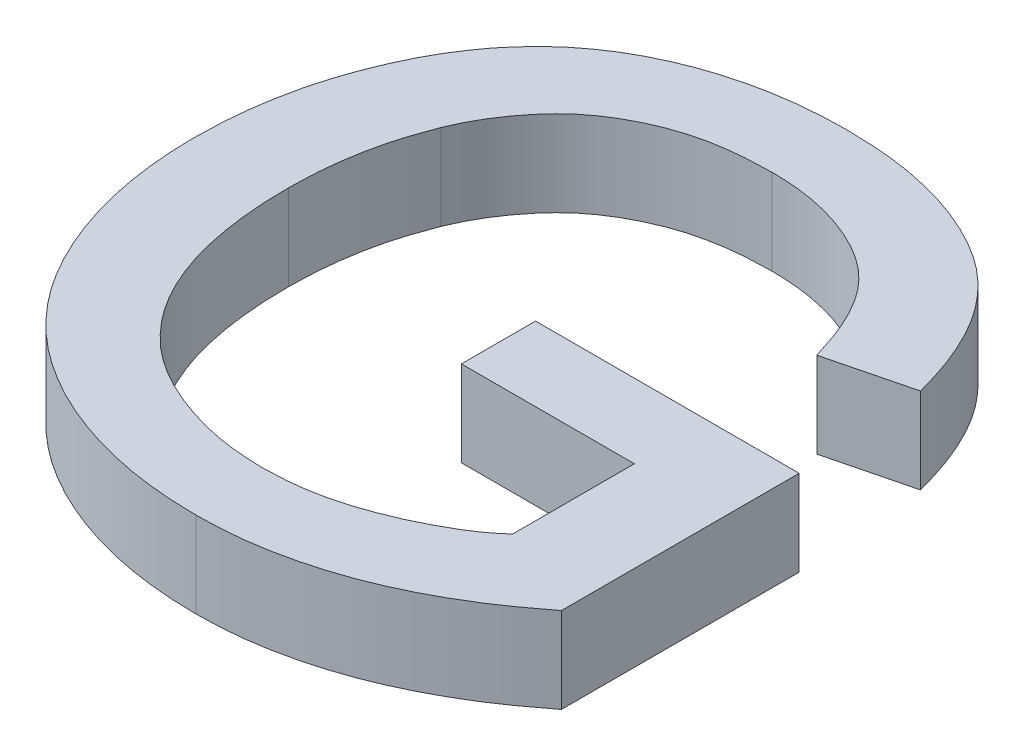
ISO-10303-21;
HEADER;
FILE_DESCRIPTION(('STEP AP214'),'2;1');
FILE_NAME('part.step','',(''),(''),'','','');
FILE_SCHEMA(('AUTOMOTIVE_DESIGN { 1 0 10303 214 1 1 1 1 }'));
ENDSEC;
DATA;
#1=APPLICATION_CONTEXT('core data for automotive mechanical design processes');
#2=APPLICATION_PROTOCOL_DEFINITION('international standard','automotive_design',2000,#1);
#3=PRODUCT_CONTEXT('',#1,'mechanical');
#4=PRODUCT('Part','Part','',(#3));
#5=PRODUCT_RELATED_PRODUCT_CATEGORY('part','',(#4));
#6=PRODUCT_DEFINITION_FORMATION('','',#4);
#7=PRODUCT_DEFINITION_CONTEXT('part definition',#1,'design');
#8=PRODUCT_DEFINITION('design','',#6,#7);
#9=PRODUCT_DEFINITION_SHAPE('','',#8);
#10=(LENGTH_UNIT() NAMED_UNIT(*) SI_UNIT(.MILLI.,.METRE.));
#11=(NAMED_UNIT(*) PLANE_ANGLE_UNIT() SI_UNIT($,.RADIAN.));
#12=(NAMED_UNIT(*) SI_UNIT($,.STERADIAN.) SOLID_ANGLE_UNIT());
#13=UNCERTAINTY_MEASURE_WITH_UNIT(LENGTH_MEASURE(1.E-05),#10,'distance_accuracy_value','');
#14=(GEOMETRIC_REPRESENTATION_CONTEXT(3) GLOBAL_UNCERTAINTY_ASSIGNED_CONTEXT((#13)) GLOBAL_UNIT_ASSIGNED_CONTEXT((#10,
#11,#12)) REPRESENTATION_CONTEXT('',''));
#15=CARTESIAN_POINT('',(0.,0.,0.));
#16=DIRECTION('',(0.,0.,1.));
#17=DIRECTION('',(1.,0.,0.));
#18=AXIS2_PLACEMENT_3D('',#15,#16,#17);
#19=CARTESIAN_POINT('',(7.63983419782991,6.40004762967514,-12.3067742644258));
#20=DIRECTION('',(0.,1.,0.));
#21=DIRECTION('',(1.,0.,0.));
#22=AXIS2_PLACEMENT_3D('',#19,#20,#21);
#23=PLANE('',#22);
#24=DIRECTION('',(1.,0.,0.));
#25=VECTOR('',#24,1.);
#26=CARTESIAN_POINT('',(0.,6.40004762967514,-13.0322890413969));
#27=LINE('',#26,#25);
#28=CARTESIAN_POINT('',(7.31451829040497,6.40004762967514,-13.0322890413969));
#29=VERTEX_POINT('',#28);
#30=CARTESIAN_POINT('',(7.92990290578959,6.40004762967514,-13.0322890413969));
#31=VERTEX_POINT('',#30);
#32=EDGE_CURVE('E156',#29,#31,#27,.T.);
#33=ORIENTED_EDGE('',*,*,#32,.T.);
#34=DIRECTION('',(0.,0.,1.));
#35=VECTOR('',#34,1.);
#36=CARTESIAN_POINT('',(7.92990290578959,6.40004762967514,0.));
#37=LINE('',#36,#35);
#38=CARTESIAN_POINT('',(7.92990290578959,6.40004762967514,-12.4773010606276));
#39=VERTEX_POINT('',#38);
#40=EDGE_CURVE('E24',#31,#39,#37,.T.);
#41=ORIENTED_EDGE('',*,*,#40,.T.);
#42=CARTESIAN_POINT('',(7.92990290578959,6.40004762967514,-12.4773010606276));
#43=CARTESIAN_POINT('',(7.90562286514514,6.40004762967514,-12.4588086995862));
#44=CARTESIAN_POINT('',(7.85783673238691,6.40004762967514,-12.4224134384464));
#45=CARTESIAN_POINT('',(7.78289392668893,6.40004762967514,-12.374948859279));
#46=CARTESIAN_POINT('',(7.70672193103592,6.40004762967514,-12.3346932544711));
#47=CARTESIAN_POINT('',(7.62953125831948,6.40004762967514,-12.3014595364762));
#48=CARTESIAN_POINT('',(7.55105659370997,6.40004762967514,-12.2758097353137));
#49=CARTESIAN_POINT('',(7.4716367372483,6.40004762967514,-12.2574502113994));
#50=CARTESIAN_POINT('',(7.39118520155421,6.40004762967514,-12.2458214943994));
#51=CARTESIAN_POINT('',(7.33709300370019,6.40004762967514,-12.2444927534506));
#52=CARTESIAN_POINT('',(7.31001107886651,6.40004762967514,-12.2438275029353));
#53=(BOUNDED_CURVE() B_SPLINE_CURVE(3,(#42,#43,#44,#45,#46,#47,#48,#49,#50,#51,#52),
.UNSPECIFIED.,.F.,.F.) B_SPLINE_CURVE_WITH_KNOTS((4,1,1,1,1,1,1,1,4),(0.,0.135541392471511,
0.266762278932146,0.393553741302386,0.517945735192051,0.639663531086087,0.759797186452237,
0.879739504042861,1.),
.UNSPECIFIED.) CURVE() GEOMETRIC_REPRESENTATION_ITEM() RATIONAL_B_SPLINE_CURVE((1.,1.,1.,1.,1.,
1.,1.,1.,1.,1.,1.)) REPRESENTATION_ITEM(''));
#54=CARTESIAN_POINT('',(7.31001107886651,6.40004762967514,-12.2438275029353));
#55=VERTEX_POINT('',#54);
#56=EDGE_CURVE('E377',#39,#55,#53,.T.);
#57=ORIENTED_EDGE('',*,*,#56,.T.);
#58=CARTESIAN_POINT('',(7.31001107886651,6.40004762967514,-12.2438275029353));
#59=CARTESIAN_POINT('',(7.29187180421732,6.40004762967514,-12.2441059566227));
#60=CARTESIAN_POINT('',(7.25583750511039,6.40004762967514,-12.2446591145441));
#61=CARTESIAN_POINT('',(7.20248689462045,6.40004762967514,-12.2493914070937));
#62=CARTESIAN_POINT('',(7.1503820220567,6.40004762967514,-12.2564229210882));
#63=CARTESIAN_POINT('',(7.09962171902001,6.40004762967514,-12.2667623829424));
#64=CARTESIAN_POINT('',(7.05002678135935,6.40004762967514,-12.279925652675));
#65=CARTESIAN_POINT('',(7.00169273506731,6.40004762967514,-12.2961930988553));
#66=CARTESIAN_POINT('',(6.95459932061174,6.40004762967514,-12.3151759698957));
#67=CARTESIAN_POINT('',(6.90900904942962,6.40004762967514,-12.3369389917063));
#68=CARTESIAN_POINT('',(6.86560717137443,6.40004762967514,-12.3618738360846));
#69=CARTESIAN_POINT('',(6.82451311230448,6.40004762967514,-12.3892129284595));
#70=CARTESIAN_POINT('',(6.78624528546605,6.40004762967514,-12.4193681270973));
#71=CARTESIAN_POINT('',(6.75074478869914,6.40004762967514,-12.4520927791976));
#72=CARTESIAN_POINT('',(6.71813998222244,6.40004762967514,-12.4875815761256));
#73=CARTESIAN_POINT('',(6.68794778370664,6.40004762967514,-12.5253628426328));
#74=CARTESIAN_POINT('',(6.66097804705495,6.40004762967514,-12.5661289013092));
#75=CARTESIAN_POINT('',(6.63663523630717,6.40004762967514,-12.609129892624));
#76=CARTESIAN_POINT('',(6.61514044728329,6.40004762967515,-12.6540404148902));
#77=CARTESIAN_POINT('',(6.59637256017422,6.40004762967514,-12.7004772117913));
#78=CARTESIAN_POINT('',(6.5808591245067,6.40004762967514,-12.7483288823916));
#79=CARTESIAN_POINT('',(6.56792071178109,6.40004762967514,-12.7973837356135));
#80=CARTESIAN_POINT('',(6.55763139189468,6.40004762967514,-12.8476232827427));
#81=CARTESIAN_POINT('',(6.55044462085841,6.40004762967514,-12.8992049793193));
#82=CARTESIAN_POINT('',(6.54621413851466,6.40004762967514,-12.952089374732));
#83=CARTESIAN_POINT('',(6.54559841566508,6.40004762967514,-12.9878103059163));
#84=CARTESIAN_POINT('',(6.54528752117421,6.40004762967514,-13.0058467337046));
#85=(BOUNDED_CURVE() B_SPLINE_CURVE(3,(#58,#59,#60,#61,#62,#63,#64,#65,#66,#67,#68,#69,#70,#71,
#72,#73,#74,#75,#76,#77,#78,#79,#80,#81,#82,#83,#84),.UNSPECIFIED.,.F.,
.F.) B_SPLINE_CURVE_WITH_KNOTS((4,1,1,1,1,1,1,1,1,1,1,1,1,1,1,1,1,1,1,1,1,1,1,1,4),(0.,
0.0446987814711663,0.0887956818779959,0.131911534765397,0.174224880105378,0.216380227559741,
0.258300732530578,0.29983275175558,0.341458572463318,0.382702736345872,0.423098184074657,
0.463001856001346,0.502657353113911,0.541964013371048,0.581674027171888,0.621727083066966,
0.662297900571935,0.7033717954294,0.744353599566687,0.785650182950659,0.827265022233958,
0.869336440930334,0.91196331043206,0.955547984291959,1.),
.UNSPECIFIED.) CURVE() GEOMETRIC_REPRESENTATION_ITEM() RATIONAL_B_SPLINE_CURVE((1.,1.,1.,1.,1.,
1.,1.,1.,1.,1.,1.,1.,1.,1.,1.,1.,1.,1.,1.,1.,1.,1.,1.,1.,1.,1.,1.)) REPRESENTATION_ITEM(''));
#86=CARTESIAN_POINT('',(6.54528752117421,6.40004762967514,-13.0058467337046));
#87=VERTEX_POINT('',#86);
#88=EDGE_CURVE('E357',#55,#87,#85,.T.);
#89=ORIENTED_EDGE('',*,*,#88,.T.);
#90=CARTESIAN_POINT('',(6.54528752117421,6.40004762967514,-13.0058467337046));
#91=CARTESIAN_POINT('',(6.54559927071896,6.40004762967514,-13.0237829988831));
#92=CARTESIAN_POINT('',(6.54621839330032,6.40004762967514,-13.0594037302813));
#93=CARTESIAN_POINT('',(6.55048501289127,6.40004762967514,-13.1124839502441));
#94=CARTESIAN_POINT('',(6.55769811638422,6.40004762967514,-13.1646347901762));
#95=CARTESIAN_POINT('',(6.56765609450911,6.40004762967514,-13.2158860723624));
#96=CARTESIAN_POINT('',(6.58022304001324,6.40004762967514,-13.266193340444));
#97=CARTESIAN_POINT('',(6.59587872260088,6.40004762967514,-13.3155663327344));
#98=CARTESIAN_POINT('',(6.61460942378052,6.40004762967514,-13.3639598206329));
#99=CARTESIAN_POINT('',(6.63582320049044,6.40004762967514,-13.4112715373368));
#100=CARTESIAN_POINT('',(6.65945016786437,6.40004762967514,-13.4568245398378));
#101=CARTESIAN_POINT('',(6.68658346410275,6.40004762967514,-13.499163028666));
#102=CARTESIAN_POINT('',(6.71511068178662,6.40004762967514,-13.5392762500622));
#103=CARTESIAN_POINT('',(6.74738539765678,6.40004762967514,-13.5754203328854));
#104=CARTESIAN_POINT('',(6.78116134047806,6.40004762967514,-13.6094614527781));
#105=CARTESIAN_POINT('',(6.81809114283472,6.40004762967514,-13.6397587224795));
#106=CARTESIAN_POINT('',(6.85724396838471,6.40004762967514,-13.6672241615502));
#107=CARTESIAN_POINT('',(6.89878915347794,6.40004762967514,-13.6915625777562));
#108=CARTESIAN_POINT('',(6.94248231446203,6.40004762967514,-13.7128028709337));
#109=CARTESIAN_POINT('',(6.98780205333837,6.40004762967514,-13.731509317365));
#110=CARTESIAN_POINT('',(7.03485122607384,6.40004762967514,-13.747032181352));
#111=CARTESIAN_POINT('',(7.08336016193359,6.40004762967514,-13.7601285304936));
#112=CARTESIAN_POINT('',(7.13359765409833,6.40004762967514,-13.7698593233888));
#113=CARTESIAN_POINT('',(7.18543421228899,6.40004762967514,-13.7771792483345));
#114=CARTESIAN_POINT('',(7.23892840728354,6.40004762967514,-13.7813601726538));
#115=CARTESIAN_POINT('',(7.275148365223,6.40004762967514,-13.7819768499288));
#116=CARTESIAN_POINT('',(7.29348463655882,6.40004762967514,-13.7822890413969));
#117=(BOUNDED_CURVE() B_SPLINE_CURVE(3,(#90,#91,#92,#93,#94,#95,#96,#97,#98,#99,#100,#101,#102,
#103,#104,#105,#106,#107,#108,#109,#110,#111,#112,#113,#114,#115,#116),.UNSPECIFIED.,.F.,
.F.) B_SPLINE_CURVE_WITH_KNOTS((4,1,1,1,1,1,1,1,1,1,1,1,1,1,1,1,1,1,1,1,1,1,1,1,4),(0.,
0.0441658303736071,0.087711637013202,0.131033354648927,0.173744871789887,0.216216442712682,
0.258650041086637,0.301201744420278,0.343924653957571,0.386289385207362,0.427414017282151,
0.467670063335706,0.507345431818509,0.546586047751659,0.585649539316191,0.624787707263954,
0.664254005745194,0.704074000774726,0.744333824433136,0.784890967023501,0.825991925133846,
0.867977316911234,0.910810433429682,0.95484798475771,1.),
.UNSPECIFIED.) CURVE() GEOMETRIC_REPRESENTATION_ITEM() RATIONAL_B_SPLINE_CURVE((1.,1.,1.,1.,1.,
1.,1.,1.,1.,1.,1.,1.,1.,1.,1.,1.,1.,1.,1.,1.,1.,1.,1.,1.,1.,1.,1.)) REPRESENTATION_ITEM(''));
#118=CARTESIAN_POINT('',(7.29348463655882,6.40004762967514,-13.7822890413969));
#119=VERTEX_POINT('',#118);
#120=EDGE_CURVE('E337',#87,#119,#117,.T.);
#121=ORIENTED_EDGE('',*,*,#120,.T.);
#122=CARTESIAN_POINT('',(7.29348463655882,6.40004762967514,-13.7822890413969));
#123=CARTESIAN_POINT('',(7.3199547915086,6.40004762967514,-13.7816522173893));
#124=CARTESIAN_POINT('',(7.37167398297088,6.40004762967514,-13.780407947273));
#125=CARTESIAN_POINT('',(7.44739426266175,6.40004762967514,-13.7707306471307));
#126=CARTESIAN_POINT('',(7.51900765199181,6.40004762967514,-13.7541714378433));
#127=CARTESIAN_POINT('',(7.57576066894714,6.40004762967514,-13.7351466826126));
#128=CARTESIAN_POINT('',(7.61838671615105,6.40004762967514,-13.716606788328));
#129=CARTESIAN_POINT('',(7.6485171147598,6.40004762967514,-13.7016228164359));
#130=CARTESIAN_POINT('',(7.67683911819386,6.40004762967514,-13.6852605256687));
#131=CARTESIAN_POINT('',(7.7036787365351,6.40004762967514,-13.6680516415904));
#132=CARTESIAN_POINT('',(7.72843664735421,6.40004762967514,-13.6488669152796));
#133=CARTESIAN_POINT('',(7.75143817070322,6.40004762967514,-13.6286084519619));
#134=CARTESIAN_POINT('',(7.7727438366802,6.40004762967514,-13.6070333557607));
#135=CARTESIAN_POINT('',(7.79897423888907,6.40004762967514,-13.5762415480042));
#136=CARTESIAN_POINT('',(7.82898069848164,6.40004762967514,-13.533468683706));
#137=CARTESIAN_POINT('',(7.85908829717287,6.40004762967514,-13.4753856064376));
#138=CARTESIAN_POINT('',(7.88545886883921,6.40004762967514,-13.4106387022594));
#139=CARTESIAN_POINT('',(7.89851061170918,6.40004762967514,-13.3642717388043));
#140=CARTESIAN_POINT('',(7.90526348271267,6.40004762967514,-13.3402818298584));
#141=(BOUNDED_CURVE() B_SPLINE_CURVE(3,(#122,#123,#124,#125,#126,#127,#128,#129,#130,#131,#132,
#133,#134,#135,#136,#137,#138,#139,#140),.UNSPECIFIED.,.F.,.F.) B_SPLINE_CURVE_WITH_KNOTS((4,1,
1,1,1,1,1,1,1,1,1,1,1,1,1,1,4),(0.,0.0962417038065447,0.188043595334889,0.277016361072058,
0.363173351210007,0.405261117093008,0.445983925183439,0.485469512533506,0.52416260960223,
0.561827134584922,0.599244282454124,0.635560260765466,0.671985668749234,0.746255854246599,
0.824952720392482,0.909431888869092,1.),
.UNSPECIFIED.) CURVE() GEOMETRIC_REPRESENTATION_ITEM() RATIONAL_B_SPLINE_CURVE((1.,1.,1.,1.,1.,
1.,1.,1.,1.,1.,1.,1.,1.,1.,1.,1.,1.,1.,1.)) REPRESENTATION_ITEM(''));
#142=CARTESIAN_POINT('',(7.90526348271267,6.40004762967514,-13.3402818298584));
#143=VERTEX_POINT('',#142);
#144=EDGE_CURVE('E320',#119,#143,#141,.T.);
#145=ORIENTED_EDGE('',*,*,#144,.T.);
#146=DIRECTION('',(-0.969787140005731,0.,0.243952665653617));
#147=VECTOR('',#146,1.);
#148=CARTESIAN_POINT('',(-2.68560748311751,6.40004762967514,-10.6761186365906));
#149=LINE('',#148,#147);
#150=CARTESIAN_POINT('',(7.71175386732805,6.40004762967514,-13.291603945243));
#151=VERTEX_POINT('',#150);
#152=EDGE_CURVE('E190',#143,#151,#149,.T.);
#153=ORIENTED_EDGE('',*,*,#152,.T.);
#154=CARTESIAN_POINT('',(7.71175386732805,6.40004762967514,-13.291603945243));
#155=CARTESIAN_POINT('',(7.7061686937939,6.40004762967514,-13.3094052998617));
#156=CARTESIAN_POINT('',(7.69547184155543,6.40004762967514,-13.3434988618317));
#157=CARTESIAN_POINT('',(7.67663051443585,6.40004762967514,-13.3911497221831));
#158=CARTESIAN_POINT('',(7.65468195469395,6.40004762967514,-13.4322958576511));
#159=CARTESIAN_POINT('',(7.63121353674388,6.40004762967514,-13.4685136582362));
#160=CARTESIAN_POINT('',(7.60325448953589,6.40004762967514,-13.4996696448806));
#161=CARTESIAN_POINT('',(7.57079293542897,6.40004762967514,-13.5272760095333));
#162=CARTESIAN_POINT('',(7.53285689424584,6.40004762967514,-13.5512512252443));
#163=CARTESIAN_POINT('',(7.49028173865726,6.40004762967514,-13.571778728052));
#164=CARTESIAN_POINT('',(7.44399506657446,6.40004762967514,-13.5885411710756));
#165=CARTESIAN_POINT('',(7.39473061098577,6.40004762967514,-13.6004863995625));
#166=CARTESIAN_POINT('',(7.34298996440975,6.40004762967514,-13.6079153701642));
#167=CARTESIAN_POINT('',(7.30763281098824,6.40004762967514,-13.6087737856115));
#168=CARTESIAN_POINT('',(7.28957838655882,6.40004762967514,-13.6092121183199));
#169=(BOUNDED_CURVE() B_SPLINE_CURVE(3,(#154,#155,#156,#157,#158,#159,#160,#161,#162,#163,#164,
#165,#166,#167,#168),.UNSPECIFIED.,.F.,.F.) B_SPLINE_CURVE_WITH_KNOTS((4,1,1,1,1,1,1,1,1,1,1,1,
4),(0.,0.0970736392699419,0.185917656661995,0.266117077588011,0.339402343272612,
0.409906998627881,0.483112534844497,0.560458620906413,0.642739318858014,0.728631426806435,
0.816102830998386,0.906096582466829,1.),
.UNSPECIFIED.) CURVE() GEOMETRIC_REPRESENTATION_ITEM() RATIONAL_B_SPLINE_CURVE((1.,1.,1.,1.,1.,
1.,1.,1.,1.,1.,1.,1.,1.,1.,1.)) REPRESENTATION_ITEM(''));
#170=CARTESIAN_POINT('',(7.28957838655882,6.40004762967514,-13.6092121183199));
#171=VERTEX_POINT('',#170);
#172=EDGE_CURVE('E293',#151,#171,#169,.T.);
#173=ORIENTED_EDGE('',*,*,#172,.T.);
#174=CARTESIAN_POINT('',(7.28957838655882,6.40004762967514,-13.6092121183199));
#175=CARTESIAN_POINT('',(7.26822244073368,6.40004762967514,-13.6086737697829));
#176=CARTESIAN_POINT('',(7.22687471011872,6.40004762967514,-13.607631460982));
#177=CARTESIAN_POINT('',(7.1669560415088,6.40004762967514,-13.6001594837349));
#178=CARTESIAN_POINT('',(7.11150740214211,6.40004762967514,-13.5874128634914));
#179=CARTESIAN_POINT('',(7.06071464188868,6.40004762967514,-13.5692500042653));
#180=CARTESIAN_POINT('',(7.01479108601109,6.40004762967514,-13.5469240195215));
#181=CARTESIAN_POINT('',(6.97307967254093,6.40004762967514,-13.5216782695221));
#182=CARTESIAN_POINT('',(6.93628751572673,6.40004762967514,-13.4927763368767));
#183=CARTESIAN_POINT('',(6.90427476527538,6.40004762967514,-13.4605868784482));
#184=CARTESIAN_POINT('',(6.87643438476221,6.40004762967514,-13.4261519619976));
#185=CARTESIAN_POINT('',(6.85160836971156,6.40004762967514,-13.3902586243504));
#186=CARTESIAN_POINT('',(6.83001892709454,6.40004762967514,-13.3526172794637));
#187=CARTESIAN_POINT('',(6.81848765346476,6.40004762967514,-13.3261745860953));
#188=CARTESIAN_POINT('',(6.81271540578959,6.40004762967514,-13.3129380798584));
#189=(BOUNDED_CURVE() B_SPLINE_CURVE(3,(#174,#175,#176,#177,#178,#179,#180,#181,#182,#183,#184,
#185,#186,#187,#188),.UNSPECIFIED.,.F.,.F.) B_SPLINE_CURVE_WITH_KNOTS((4,1,1,1,1,1,1,1,1,1,1,1,
4),(0.,0.106840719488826,0.206856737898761,0.30155333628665,0.390955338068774,0.476129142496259,
0.556665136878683,0.634464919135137,0.709590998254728,0.783321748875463,0.855746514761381,
0.927790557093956,1.),
.UNSPECIFIED.) CURVE() GEOMETRIC_REPRESENTATION_ITEM() RATIONAL_B_SPLINE_CURVE((1.,1.,1.,1.,1.,
1.,1.,1.,1.,1.,1.,1.,1.,1.,1.)) REPRESENTATION_ITEM(''));
#190=CARTESIAN_POINT('',(6.81271540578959,6.40004762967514,-13.3129380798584));
#191=VERTEX_POINT('',#190);
#192=EDGE_CURVE('E273',#171,#191,#189,.T.);
#193=ORIENTED_EDGE('',*,*,#192,.T.);
#194=CARTESIAN_POINT('',(6.81271540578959,6.40004762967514,-13.3129380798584));
#195=CARTESIAN_POINT('',(6.80409577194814,6.40004762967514,-13.2896574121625));
#196=CARTESIAN_POINT('',(6.78674594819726,6.40004762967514,-13.2427974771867));
#197=CARTESIAN_POINT('',(6.76979688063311,6.40004762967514,-13.1689448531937));
#198=CARTESIAN_POINT('',(6.75885602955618,6.40004762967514,-13.0923146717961));
#199=CARTESIAN_POINT('',(6.7575094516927,6.40004762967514,-13.0401406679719));
#200=CARTESIAN_POINT('',(6.75682598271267,6.40004762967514,-13.0136592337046));
#201=(BOUNDED_CURVE() B_SPLINE_CURVE(3,(#194,#195,#196,#197,#198,#199,#200),.UNSPECIFIED.,.F.,
.F.) B_SPLINE_CURVE_WITH_KNOTS((4,1,1,1,4),(0.,0.242983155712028,0.489082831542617,
0.740678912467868,1.),
.UNSPECIFIED.) CURVE() GEOMETRIC_REPRESENTATION_ITEM() RATIONAL_B_SPLINE_CURVE((1.,1.,1.,1.,1.,
1.,1.)) REPRESENTATION_ITEM(''));
#202=CARTESIAN_POINT('',(6.75682598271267,6.40004762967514,-13.0136592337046));
#203=VERTEX_POINT('',#202);
#204=EDGE_CURVE('E253',#191,#203,#201,.T.);
#205=ORIENTED_EDGE('',*,*,#204,.T.);
#206=CARTESIAN_POINT('',(6.75682598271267,6.40004762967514,-13.0136592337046));
#207=CARTESIAN_POINT('',(6.75692956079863,6.40004762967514,-12.9974254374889));
#208=CARTESIAN_POINT('',(6.75713247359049,6.40004762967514,-12.9656229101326));
#209=CARTESIAN_POINT('',(6.76076935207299,6.40004762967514,-12.9189278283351));
#210=CARTESIAN_POINT('',(6.76552468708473,6.40004762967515,-12.8741338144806));
#211=CARTESIAN_POINT('',(6.77324234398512,6.40004762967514,-12.8314605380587));
#212=CARTESIAN_POINT('',(6.78241793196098,6.40004762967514,-12.7907808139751));
#213=CARTESIAN_POINT('',(6.79379888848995,6.40004762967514,-12.7520723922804));
#214=CARTESIAN_POINT('',(6.8077104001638,6.40004762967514,-12.7155284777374));
#215=CARTESIAN_POINT('',(6.82324870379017,6.40004762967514,-12.6807912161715));
#216=CARTESIAN_POINT('',(6.84102719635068,6.40004762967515,-12.648235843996));
#217=CARTESIAN_POINT('',(6.86082547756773,6.40004762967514,-12.6178970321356));
#218=CARTESIAN_POINT('',(6.88257006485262,6.40004762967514,-12.5897909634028));
#219=CARTESIAN_POINT('',(6.90618680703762,6.40004762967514,-12.5638866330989));
#220=CARTESIAN_POINT('',(6.93132537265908,6.40004762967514,-12.5396636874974));
#221=CARTESIAN_POINT('',(6.95877305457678,6.40004762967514,-12.5180464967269));
#222=CARTESIAN_POINT('',(6.98822120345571,6.40004762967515,-12.4987210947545));
#223=CARTESIAN_POINT('',(7.02953576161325,6.40004762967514,-12.4757068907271));
#224=CARTESIAN_POINT('',(7.08401028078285,6.40004762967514,-12.4524738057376));
#225=CARTESIAN_POINT('',(7.15153522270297,6.40004762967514,-12.4317452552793));
#226=CARTESIAN_POINT('',(7.22132307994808,6.40004762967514,-12.4194340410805));
#227=CARTESIAN_POINT('',(7.26849723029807,6.40004762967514,-12.4177523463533));
#228=CARTESIAN_POINT('',(7.2922827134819,6.40004762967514,-12.4169044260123));
#229=(BOUNDED_CURVE() B_SPLINE_CURVE(3,(#206,#207,#208,#209,#210,#211,#212,#213,#214,#215,#216,
#217,#218,#219,#220,#221,#222,#223,#224,#225,#226,#227,#228),.UNSPECIFIED.,.F.,
.F.) B_SPLINE_CURVE_WITH_KNOTS((4,1,1,1,1,1,1,1,1,1,1,1,1,1,1,1,1,1,1,1,4),(0.,
0.0535380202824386,0.104882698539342,0.154435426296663,0.202077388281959,0.24784571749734,
0.291964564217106,0.335046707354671,0.376749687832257,0.417413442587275,0.457280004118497,
0.496142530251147,0.534505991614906,0.572835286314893,0.611177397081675,0.649576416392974,
0.688923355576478,0.767063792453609,0.844414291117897,0.921552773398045,1.),
.UNSPECIFIED.) CURVE() GEOMETRIC_REPRESENTATION_ITEM() RATIONAL_B_SPLINE_CURVE((1.,1.,1.,1.,1.,
1.,1.,1.,1.,1.,1.,1.,1.,1.,1.,1.,1.,1.,1.,1.,1.,1.,1.)) REPRESENTATION_ITEM(''));
#230=CARTESIAN_POINT('',(7.2922827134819,6.40004762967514,-12.4169044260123));
#231=VERTEX_POINT('',#230);
#232=EDGE_CURVE('E205',#203,#231,#229,.T.);
#233=ORIENTED_EDGE('',*,*,#232,.T.);
#234=CARTESIAN_POINT('',(7.2922827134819,6.40004762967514,-12.4169044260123));
#235=CARTESIAN_POINT('',(7.31314777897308,6.40004762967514,-12.4175911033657));
#236=CARTESIAN_POINT('',(7.35478174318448,6.40004762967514,-12.418961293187));
#237=CARTESIAN_POINT('',(7.41676604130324,6.40004762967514,-12.4284693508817));
#238=CARTESIAN_POINT('',(7.47777587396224,6.40004762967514,-12.4446143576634));
#239=CARTESIAN_POINT('',(7.53676275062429,6.40004762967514,-12.4664119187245));
#240=CARTESIAN_POINT('',(7.59194111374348,6.40004762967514,-12.491379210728));
#241=CARTESIAN_POINT('',(7.64078342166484,6.40004762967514,-12.5181316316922));
#242=CARTESIAN_POINT('',(7.68319637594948,6.40004762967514,-12.5448261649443));
#243=CARTESIAN_POINT('',(7.70705360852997,6.40004762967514,-12.5652664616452));
#244=CARTESIAN_POINT('',(7.71836444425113,6.40004762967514,-12.5749573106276));
#245=(BOUNDED_CURVE() B_SPLINE_CURVE(3,(#234,#235,#236,#237,#238,#239,#240,#241,#242,#243,#244),
.UNSPECIFIED.,.F.,.F.) B_SPLINE_CURVE_WITH_KNOTS((4,1,1,1,1,1,1,1,4),(0.,0.135097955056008,
0.269573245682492,0.405025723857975,0.543117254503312,0.676347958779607,0.796803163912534,
0.903663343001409,1.),
.UNSPECIFIED.) CURVE() GEOMETRIC_REPRESENTATION_ITEM() RATIONAL_B_SPLINE_CURVE((1.,1.,1.,1.,1.,
1.,1.,1.,1.,1.,1.)) REPRESENTATION_ITEM(''));
#246=CARTESIAN_POINT('',(7.71836444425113,6.40004762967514,-12.5749573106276));
#247=VERTEX_POINT('',#246);
#248=EDGE_CURVE('E199',#231,#247,#245,.T.);
#249=ORIENTED_EDGE('',*,*,#248,.T.);
#250=DIRECTION('',(0.,0.,-1.));
#251=VECTOR('',#250,1.);
#252=CARTESIAN_POINT('',(7.71836444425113,6.40004762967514,0.));
#253=LINE('',#252,#251);
#254=CARTESIAN_POINT('',(7.71836444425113,6.40004762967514,-12.8592121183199));
#255=VERTEX_POINT('',#254);
#256=EDGE_CURVE('E220',#247,#255,#253,.T.);
#257=ORIENTED_EDGE('',*,*,#256,.T.);
#258=DIRECTION('',(-1.,0.,0.));
#259=VECTOR('',#258,1.);
#260=CARTESIAN_POINT('',(0.,6.40004762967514,-12.8592121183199));
#261=LINE('',#260,#259);
#262=CARTESIAN_POINT('',(7.31451829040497,6.40004762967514,-12.8592121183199));
#263=VERTEX_POINT('',#262);
#264=EDGE_CURVE('E158',#255,#263,#261,.T.);
#265=ORIENTED_EDGE('',*,*,#264,.T.);
#266=DIRECTION('',(0.,0.,-1.));
#267=VECTOR('',#266,1.);
#268=CARTESIAN_POINT('',(7.31451829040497,6.40004762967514,0.));
#269=LINE('',#268,#267);
#270=EDGE_CURVE('E153',#263,#29,#269,.T.);
#271=ORIENTED_EDGE('',*,*,#270,.T.);
#272=EDGE_LOOP('',(#33,#41,#57,#89,#121,#145,#153,#173,#193,#205,#233,#249,#257,#265,#271));
#273=FACE_BOUND('',#272,.T.);
#274=ADVANCED_FACE('F16',(#273),#23,.F.);
#275=CARTESIAN_POINT('',(7.63983419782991,6.60004762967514,-12.3067742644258));
#276=DIRECTION('',(0.,1.,0.));
#277=DIRECTION('',(1.,0.,0.));
#278=AXIS2_PLACEMENT_3D('',#275,#276,#277);
#279=PLANE('',#278);
#280=DIRECTION('',(1.,0.,0.));
#281=VECTOR('',#280,1.);
#282=CARTESIAN_POINT('',(0.,6.60004762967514,-13.0322890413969));
#283=LINE('',#282,#281);
#284=CARTESIAN_POINT('',(7.31451829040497,6.60004762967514,-13.0322890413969));
#285=VERTEX_POINT('',#284);
#286=CARTESIAN_POINT('',(7.92990290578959,6.60004762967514,-13.0322890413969));
#287=VERTEX_POINT('',#286);
#288=EDGE_CURVE('E175',#285,#287,#283,.T.);
#289=ORIENTED_EDGE('',*,*,#288,.F.);
#290=DIRECTION('',(0.,0.,-1.));
#291=VECTOR('',#290,1.);
#292=CARTESIAN_POINT('',(7.31451829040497,6.60004762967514,0.));
#293=LINE('',#292,#291);
#294=CARTESIAN_POINT('',(7.31451829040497,6.60004762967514,-12.8592121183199));
#295=VERTEX_POINT('',#294);
#296=EDGE_CURVE('E170',#295,#285,#293,.T.);
#297=ORIENTED_EDGE('',*,*,#296,.F.);
#298=DIRECTION('',(-1.,0.,0.));
#299=VECTOR('',#298,1.);
#300=CARTESIAN_POINT('',(0.,6.60004762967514,-12.8592121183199));
#301=LINE('',#300,#299);
#302=CARTESIAN_POINT('',(7.71836444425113,6.60004762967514,-12.8592121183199));
#303=VERTEX_POINT('',#302);
#304=EDGE_CURVE('E217',#303,#295,#301,.T.);
#305=ORIENTED_EDGE('',*,*,#304,.F.);
#306=DIRECTION('',(0.,0.,-1.));
#307=VECTOR('',#306,1.);
#308=CARTESIAN_POINT('',(7.71836444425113,6.60004762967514,0.));
#309=LINE('',#308,#307);
#310=CARTESIAN_POINT('',(7.71836444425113,6.60004762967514,-12.5749573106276));
#311=VERTEX_POINT('',#310);
#312=EDGE_CURVE('E227',#311,#303,#309,.T.);
#313=ORIENTED_EDGE('',*,*,#312,.F.);
#314=CARTESIAN_POINT('',(7.2922827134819,6.60004762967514,-12.4169044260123));
#315=CARTESIAN_POINT('',(7.31314777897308,6.60004762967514,-12.4175911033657));
#316=CARTESIAN_POINT('',(7.35478174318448,6.60004762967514,-12.418961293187));
#317=CARTESIAN_POINT('',(7.41676604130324,6.60004762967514,-12.4284693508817));
#318=CARTESIAN_POINT('',(7.47777587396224,6.60004762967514,-12.4446143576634));
#319=CARTESIAN_POINT('',(7.53676275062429,6.60004762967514,-12.4664119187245));
#320=CARTESIAN_POINT('',(7.59194111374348,6.60004762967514,-12.491379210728));
#321=CARTESIAN_POINT('',(7.64078342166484,6.60004762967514,-12.5181316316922));
#322=CARTESIAN_POINT('',(7.68319637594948,6.60004762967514,-12.5448261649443));
#323=CARTESIAN_POINT('',(7.70705360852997,6.60004762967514,-12.5652664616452));
#324=CARTESIAN_POINT('',(7.71836444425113,6.60004762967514,-12.5749573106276));
#325=(BOUNDED_CURVE() B_SPLINE_CURVE(3,(#314,#315,#316,#317,#318,#319,#320,#321,#322,#323,#324),
.UNSPECIFIED.,.F.,.F.) B_SPLINE_CURVE_WITH_KNOTS((4,1,1,1,1,1,1,1,4),(0.,0.135097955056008,
0.269573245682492,0.405025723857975,0.543117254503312,0.676347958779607,0.796803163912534,
0.903663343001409,1.),
.UNSPECIFIED.) CURVE() GEOMETRIC_REPRESENTATION_ITEM() RATIONAL_B_SPLINE_CURVE((1.,1.,1.,1.,1.,
1.,1.,1.,1.,1.,1.)) REPRESENTATION_ITEM(''));
#326=CARTESIAN_POINT('',(7.2922827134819,6.60004762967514,-12.4169044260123));
#327=VERTEX_POINT('',#326);
#328=EDGE_CURVE('E198',#327,#311,#325,.T.);
#329=ORIENTED_EDGE('',*,*,#328,.F.);
#330=CARTESIAN_POINT('',(6.75682598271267,6.60004762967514,-13.0136592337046));
#331=CARTESIAN_POINT('',(6.75692956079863,6.60004762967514,-12.9974254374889));
#332=CARTESIAN_POINT('',(6.75713247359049,6.60004762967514,-12.9656229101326));
#333=CARTESIAN_POINT('',(6.76076935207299,6.60004762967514,-12.9189278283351));
#334=CARTESIAN_POINT('',(6.76552468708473,6.60004762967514,-12.8741338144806));
#335=CARTESIAN_POINT('',(6.77324234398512,6.60004762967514,-12.8314605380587));
#336=CARTESIAN_POINT('',(6.78241793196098,6.60004762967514,-12.7907808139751));
#337=CARTESIAN_POINT('',(6.79379888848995,6.60004762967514,-12.7520723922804));
#338=CARTESIAN_POINT('',(6.8077104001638,6.60004762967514,-12.7155284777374));
#339=CARTESIAN_POINT('',(6.82324870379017,6.60004762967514,-12.6807912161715));
#340=CARTESIAN_POINT('',(6.84102719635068,6.60004762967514,-12.648235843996));
#341=CARTESIAN_POINT('',(6.86082547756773,6.60004762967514,-12.6178970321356));
#342=CARTESIAN_POINT('',(6.88257006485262,6.60004762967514,-12.5897909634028));
#343=CARTESIAN_POINT('',(6.90618680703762,6.60004762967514,-12.5638866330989));
#344=CARTESIAN_POINT('',(6.93132537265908,6.60004762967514,-12.5396636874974));
#345=CARTESIAN_POINT('',(6.95877305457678,6.60004762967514,-12.5180464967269));
#346=CARTESIAN_POINT('',(6.98822120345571,6.60004762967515,-12.4987210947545));
#347=CARTESIAN_POINT('',(7.02953576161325,6.60004762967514,-12.4757068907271));
#348=CARTESIAN_POINT('',(7.08401028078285,6.60004762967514,-12.4524738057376));
#349=CARTESIAN_POINT('',(7.15153522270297,6.60004762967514,-12.4317452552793));
#350=CARTESIAN_POINT('',(7.22132307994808,6.60004762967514,-12.4194340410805));
#351=CARTESIAN_POINT('',(7.26849723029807,6.60004762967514,-12.4177523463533));
#352=CARTESIAN_POINT('',(7.2922827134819,6.60004762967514,-12.4169044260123));
#353=(BOUNDED_CURVE() B_SPLINE_CURVE(3,(#330,#331,#332,#333,#334,#335,#336,#337,#338,#339,#340,
#341,#342,#343,#344,#345,#346,#347,#348,#349,#350,#351,#352),.UNSPECIFIED.,.F.,
.F.) B_SPLINE_CURVE_WITH_KNOTS((4,1,1,1,1,1,1,1,1,1,1,1,1,1,1,1,1,1,1,1,4),(0.,
0.0535380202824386,0.104882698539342,0.154435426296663,0.202077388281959,0.24784571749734,
0.291964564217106,0.335046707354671,0.376749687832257,0.417413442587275,0.457280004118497,
0.496142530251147,0.534505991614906,0.572835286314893,0.611177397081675,0.649576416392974,
0.688923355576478,0.767063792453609,0.844414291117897,0.921552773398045,1.),
.UNSPECIFIED.) CURVE() GEOMETRIC_REPRESENTATION_ITEM() RATIONAL_B_SPLINE_CURVE((1.,1.,1.,1.,1.,
1.,1.,1.,1.,1.,1.,1.,1.,1.,1.,1.,1.,1.,1.,1.,1.,1.,1.)) REPRESENTATION_ITEM(''));
#354=CARTESIAN_POINT('',(6.75682598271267,6.60004762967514,-13.0136592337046));
#355=VERTEX_POINT('',#354);
#356=EDGE_CURVE('E248',#355,#327,#353,.T.);
#357=ORIENTED_EDGE('',*,*,#356,.F.);
#358=CARTESIAN_POINT('',(6.81271540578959,6.60004762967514,-13.3129380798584));
#359=CARTESIAN_POINT('',(6.80409577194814,6.60004762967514,-13.2896574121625));
#360=CARTESIAN_POINT('',(6.78674594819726,6.60004762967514,-13.2427974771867));
#361=CARTESIAN_POINT('',(6.76979688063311,6.60004762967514,-13.1689448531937));
#362=CARTESIAN_POINT('',(6.75885602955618,6.60004762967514,-13.0923146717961));
#363=CARTESIAN_POINT('',(6.7575094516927,6.60004762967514,-13.0401406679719));
#364=CARTESIAN_POINT('',(6.75682598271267,6.60004762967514,-13.0136592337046));
#365=(BOUNDED_CURVE() B_SPLINE_CURVE(3,(#358,#359,#360,#361,#362,#363,#364),.UNSPECIFIED.,.F.,
.F.) B_SPLINE_CURVE_WITH_KNOTS((4,1,1,1,4),(0.,0.242983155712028,0.489082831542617,
0.740678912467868,1.),
.UNSPECIFIED.) CURVE() GEOMETRIC_REPRESENTATION_ITEM() RATIONAL_B_SPLINE_CURVE((1.,1.,1.,1.,1.,
1.,1.)) REPRESENTATION_ITEM(''));
#366=CARTESIAN_POINT('',(6.81271540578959,6.60004762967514,-13.3129380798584));
#367=VERTEX_POINT('',#366);
#368=EDGE_CURVE('E268',#367,#355,#365,.T.);
#369=ORIENTED_EDGE('',*,*,#368,.F.);
#370=CARTESIAN_POINT('',(7.28957838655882,6.60004762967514,-13.6092121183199));
#371=CARTESIAN_POINT('',(7.26822244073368,6.60004762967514,-13.6086737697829));
#372=CARTESIAN_POINT('',(7.22687471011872,6.60004762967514,-13.607631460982));
#373=CARTESIAN_POINT('',(7.1669560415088,6.60004762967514,-13.6001594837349));
#374=CARTESIAN_POINT('',(7.11150740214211,6.60004762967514,-13.5874128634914));
#375=CARTESIAN_POINT('',(7.06071464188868,6.60004762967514,-13.5692500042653));
#376=CARTESIAN_POINT('',(7.01479108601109,6.60004762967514,-13.5469240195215));
#377=CARTESIAN_POINT('',(6.97307967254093,6.60004762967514,-13.5216782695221));
#378=CARTESIAN_POINT('',(6.93628751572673,6.60004762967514,-13.4927763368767));
#379=CARTESIAN_POINT('',(6.90427476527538,6.60004762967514,-13.4605868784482));
#380=CARTESIAN_POINT('',(6.87643438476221,6.60004762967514,-13.4261519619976));
#381=CARTESIAN_POINT('',(6.85160836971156,6.60004762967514,-13.3902586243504));
#382=CARTESIAN_POINT('',(6.83001892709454,6.60004762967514,-13.3526172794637));
#383=CARTESIAN_POINT('',(6.81848765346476,6.60004762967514,-13.3261745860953));
#384=CARTESIAN_POINT('',(6.81271540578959,6.60004762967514,-13.3129380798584));
#385=(BOUNDED_CURVE() B_SPLINE_CURVE(3,(#370,#371,#372,#373,#374,#375,#376,#377,#378,#379,#380,
#381,#382,#383,#384),.UNSPECIFIED.,.F.,.F.) B_SPLINE_CURVE_WITH_KNOTS((4,1,1,1,1,1,1,1,1,1,1,1,
4),(0.,0.106840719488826,0.206856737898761,0.30155333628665,0.390955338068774,0.476129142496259,
0.556665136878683,0.634464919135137,0.709590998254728,0.783321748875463,0.855746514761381,
0.927790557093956,1.),
.UNSPECIFIED.) CURVE() GEOMETRIC_REPRESENTATION_ITEM() RATIONAL_B_SPLINE_CURVE((1.,1.,1.,1.,1.,
1.,1.,1.,1.,1.,1.,1.,1.,1.,1.)) REPRESENTATION_ITEM(''));
#386=CARTESIAN_POINT('',(7.28957838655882,6.60004762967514,-13.6092121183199));
#387=VERTEX_POINT('',#386);
#388=EDGE_CURVE('E288',#387,#367,#385,.T.);
#389=ORIENTED_EDGE('',*,*,#388,.F.);
#390=CARTESIAN_POINT('',(7.71175386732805,6.60004762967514,-13.291603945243));
#391=CARTESIAN_POINT('',(7.7061686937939,6.60004762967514,-13.3094052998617));
#392=CARTESIAN_POINT('',(7.69547184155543,6.60004762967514,-13.3434988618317));
#393=CARTESIAN_POINT('',(7.67663051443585,6.60004762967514,-13.3911497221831));
#394=CARTESIAN_POINT('',(7.65468195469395,6.60004762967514,-13.4322958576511));
#395=CARTESIAN_POINT('',(7.63121353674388,6.60004762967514,-13.4685136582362));
#396=CARTESIAN_POINT('',(7.60325448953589,6.60004762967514,-13.4996696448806));
#397=CARTESIAN_POINT('',(7.57079293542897,6.60004762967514,-13.5272760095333));
#398=CARTESIAN_POINT('',(7.53285689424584,6.60004762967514,-13.5512512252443));
#399=CARTESIAN_POINT('',(7.49028173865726,6.60004762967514,-13.571778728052));
#400=CARTESIAN_POINT('',(7.44399506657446,6.60004762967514,-13.5885411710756));
#401=CARTESIAN_POINT('',(7.39473061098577,6.60004762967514,-13.6004863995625));
#402=CARTESIAN_POINT('',(7.34298996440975,6.60004762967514,-13.6079153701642));
#403=CARTESIAN_POINT('',(7.30763281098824,6.60004762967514,-13.6087737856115));
#404=CARTESIAN_POINT('',(7.28957838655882,6.60004762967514,-13.6092121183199));
#405=(BOUNDED_CURVE() B_SPLINE_CURVE(3,(#390,#391,#392,#393,#394,#395,#396,#397,#398,#399,#400,
#401,#402,#403,#404),.UNSPECIFIED.,.F.,.F.) B_SPLINE_CURVE_WITH_KNOTS((4,1,1,1,1,1,1,1,1,1,1,1,
4),(0.,0.0970736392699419,0.185917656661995,0.266117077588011,0.339402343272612,
0.409906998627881,0.483112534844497,0.560458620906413,0.642739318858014,0.728631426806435,
0.816102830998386,0.906096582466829,1.),
.UNSPECIFIED.) CURVE() GEOMETRIC_REPRESENTATION_ITEM() RATIONAL_B_SPLINE_CURVE((1.,1.,1.,1.,1.,
1.,1.,1.,1.,1.,1.,1.,1.,1.,1.)) REPRESENTATION_ITEM(''));
#406=CARTESIAN_POINT('',(7.71175386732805,6.60004762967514,-13.291603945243));
#407=VERTEX_POINT('',#406);
#408=EDGE_CURVE('E308',#407,#387,#405,.T.);
#409=ORIENTED_EDGE('',*,*,#408,.F.);
#410=DIRECTION('',(-0.969787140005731,0.,0.243952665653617));
#411=VECTOR('',#410,1.);
#412=CARTESIAN_POINT('',(-2.68560748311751,6.60004762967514,-10.6761186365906));
#413=LINE('',#412,#411);
#414=CARTESIAN_POINT('',(7.90526348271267,6.60004762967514,-13.3402818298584));
#415=VERTEX_POINT('',#414);
#416=EDGE_CURVE('E189',#415,#407,#413,.T.);
#417=ORIENTED_EDGE('',*,*,#416,.F.);
#418=CARTESIAN_POINT('',(7.29348463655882,6.60004762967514,-13.7822890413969));
#419=CARTESIAN_POINT('',(7.3199547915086,6.60004762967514,-13.7816522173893));
#420=CARTESIAN_POINT('',(7.37167398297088,6.60004762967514,-13.780407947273));
#421=CARTESIAN_POINT('',(7.44739426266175,6.60004762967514,-13.7707306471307));
#422=CARTESIAN_POINT('',(7.51900765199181,6.60004762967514,-13.7541714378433));
#423=CARTESIAN_POINT('',(7.57576066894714,6.60004762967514,-13.7351466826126));
#424=CARTESIAN_POINT('',(7.61838671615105,6.60004762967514,-13.716606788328));
#425=CARTESIAN_POINT('',(7.6485171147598,6.60004762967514,-13.7016228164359));
#426=CARTESIAN_POINT('',(7.67683911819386,6.60004762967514,-13.6852605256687));
#427=CARTESIAN_POINT('',(7.7036787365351,6.60004762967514,-13.6680516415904));
#428=CARTESIAN_POINT('',(7.72843664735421,6.60004762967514,-13.6488669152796));
#429=CARTESIAN_POINT('',(7.75143817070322,6.60004762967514,-13.6286084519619));
#430=CARTESIAN_POINT('',(7.7727438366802,6.60004762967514,-13.6070333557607));
#431=CARTESIAN_POINT('',(7.79897423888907,6.60004762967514,-13.5762415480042));
#432=CARTESIAN_POINT('',(7.82898069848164,6.60004762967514,-13.533468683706));
#433=CARTESIAN_POINT('',(7.85908829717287,6.60004762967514,-13.4753856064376));
#434=CARTESIAN_POINT('',(7.88545886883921,6.60004762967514,-13.4106387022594));
#435=CARTESIAN_POINT('',(7.89851061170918,6.60004762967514,-13.3642717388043));
#436=CARTESIAN_POINT('',(7.90526348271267,6.60004762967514,-13.3402818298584));
#437=(BOUNDED_CURVE() B_SPLINE_CURVE(3,(#418,#419,#420,#421,#422,#423,#424,#425,#426,#427,#428,
#429,#430,#431,#432,#433,#434,#435,#436),.UNSPECIFIED.,.F.,.F.) B_SPLINE_CURVE_WITH_KNOTS((4,1,
1,1,1,1,1,1,1,1,1,1,1,1,1,1,4),(0.,0.0962417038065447,0.188043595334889,0.277016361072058,
0.363173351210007,0.405261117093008,0.445983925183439,0.485469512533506,0.52416260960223,
0.561827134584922,0.599244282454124,0.635560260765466,0.671985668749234,0.746255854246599,
0.824952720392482,0.909431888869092,1.),
.UNSPECIFIED.) CURVE() GEOMETRIC_REPRESENTATION_ITEM() RATIONAL_B_SPLINE_CURVE((1.,1.,1.,1.,1.,
1.,1.,1.,1.,1.,1.,1.,1.,1.,1.,1.,1.,1.,1.)) REPRESENTATION_ITEM(''));
#438=CARTESIAN_POINT('',(7.29348463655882,6.60004762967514,-13.7822890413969));
#439=VERTEX_POINT('',#438);
#440=EDGE_CURVE('E332',#439,#415,#437,.T.);
#441=ORIENTED_EDGE('',*,*,#440,.F.);
#442=CARTESIAN_POINT('',(6.54528752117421,6.60004762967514,-13.0058467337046));
#443=CARTESIAN_POINT('',(6.54559927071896,6.60004762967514,-13.0237829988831));
#444=CARTESIAN_POINT('',(6.54621839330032,6.60004762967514,-13.0594037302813));
#445=CARTESIAN_POINT('',(6.55048501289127,6.60004762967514,-13.1124839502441));
#446=CARTESIAN_POINT('',(6.55769811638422,6.60004762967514,-13.1646347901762));
#447=CARTESIAN_POINT('',(6.56765609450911,6.60004762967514,-13.2158860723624));
#448=CARTESIAN_POINT('',(6.58022304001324,6.60004762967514,-13.266193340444));
#449=CARTESIAN_POINT('',(6.59587872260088,6.60004762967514,-13.3155663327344));
#450=CARTESIAN_POINT('',(6.61460942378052,6.60004762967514,-13.3639598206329));
#451=CARTESIAN_POINT('',(6.63582320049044,6.60004762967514,-13.4112715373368));
#452=CARTESIAN_POINT('',(6.65945016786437,6.60004762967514,-13.4568245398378));
#453=CARTESIAN_POINT('',(6.68658346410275,6.60004762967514,-13.499163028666));
#454=CARTESIAN_POINT('',(6.71511068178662,6.60004762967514,-13.5392762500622));
#455=CARTESIAN_POINT('',(6.74738539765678,6.60004762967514,-13.5754203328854));
#456=CARTESIAN_POINT('',(6.78116134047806,6.60004762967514,-13.6094614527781));
#457=CARTESIAN_POINT('',(6.81809114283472,6.60004762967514,-13.6397587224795));
#458=CARTESIAN_POINT('',(6.85724396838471,6.60004762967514,-13.6672241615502));
#459=CARTESIAN_POINT('',(6.89878915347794,6.60004762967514,-13.6915625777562));
#460=CARTESIAN_POINT('',(6.94248231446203,6.60004762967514,-13.7128028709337));
#461=CARTESIAN_POINT('',(6.98780205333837,6.60004762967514,-13.731509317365));
#462=CARTESIAN_POINT('',(7.03485122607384,6.60004762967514,-13.747032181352));
#463=CARTESIAN_POINT('',(7.08336016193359,6.60004762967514,-13.7601285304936));
#464=CARTESIAN_POINT('',(7.13359765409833,6.60004762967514,-13.7698593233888));
#465=CARTESIAN_POINT('',(7.18543421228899,6.60004762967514,-13.7771792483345));
#466=CARTESIAN_POINT('',(7.23892840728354,6.60004762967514,-13.7813601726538));
#467=CARTESIAN_POINT('',(7.275148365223,6.60004762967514,-13.7819768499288));
#468=CARTESIAN_POINT('',(7.29348463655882,6.60004762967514,-13.7822890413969));
#469=(BOUNDED_CURVE() B_SPLINE_CURVE(3,(#442,#443,#444,#445,#446,#447,#448,#449,#450,#451,#452,
#453,#454,#455,#456,#457,#458,#459,#460,#461,#462,#463,#464,#465,#466,#467,#468),.UNSPECIFIED.,
.F.,.F.) B_SPLINE_CURVE_WITH_KNOTS((4,1,1,1,1,1,1,1,1,1,1,1,1,1,1,1,1,1,1,1,1,1,1,1,4),(0.,
0.0441658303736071,0.087711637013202,0.131033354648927,0.173744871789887,0.216216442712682,
0.258650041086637,0.301201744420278,0.343924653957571,0.386289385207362,0.427414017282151,
0.467670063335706,0.507345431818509,0.546586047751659,0.585649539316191,0.624787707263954,
0.664254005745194,0.704074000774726,0.744333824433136,0.784890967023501,0.825991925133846,
0.867977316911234,0.910810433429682,0.95484798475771,1.),
.UNSPECIFIED.) CURVE() GEOMETRIC_REPRESENTATION_ITEM() RATIONAL_B_SPLINE_CURVE((1.,1.,1.,1.,1.,
1.,1.,1.,1.,1.,1.,1.,1.,1.,1.,1.,1.,1.,1.,1.,1.,1.,1.,1.,1.,1.,1.)) REPRESENTATION_ITEM(''));
#470=CARTESIAN_POINT('',(6.54528752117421,6.60004762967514,-13.0058467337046));
#471=VERTEX_POINT('',#470);
#472=EDGE_CURVE('E352',#471,#439,#469,.T.);
#473=ORIENTED_EDGE('',*,*,#472,.F.);
#474=CARTESIAN_POINT('',(7.31001107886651,6.60004762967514,-12.2438275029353));
#475=CARTESIAN_POINT('',(7.29187180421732,6.60004762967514,-12.2441059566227));
#476=CARTESIAN_POINT('',(7.25583750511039,6.60004762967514,-12.2446591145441));
#477=CARTESIAN_POINT('',(7.20248689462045,6.60004762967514,-12.2493914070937));
#478=CARTESIAN_POINT('',(7.1503820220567,6.60004762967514,-12.2564229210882));
#479=CARTESIAN_POINT('',(7.09962171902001,6.60004762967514,-12.2667623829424));
#480=CARTESIAN_POINT('',(7.05002678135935,6.60004762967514,-12.279925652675));
#481=CARTESIAN_POINT('',(7.00169273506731,6.60004762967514,-12.2961930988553));
#482=CARTESIAN_POINT('',(6.95459932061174,6.60004762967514,-12.3151759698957));
#483=CARTESIAN_POINT('',(6.90900904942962,6.60004762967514,-12.3369389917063));
#484=CARTESIAN_POINT('',(6.86560717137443,6.60004762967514,-12.3618738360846));
#485=CARTESIAN_POINT('',(6.82451311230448,6.60004762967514,-12.3892129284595));
#486=CARTESIAN_POINT('',(6.78624528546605,6.60004762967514,-12.4193681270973));
#487=CARTESIAN_POINT('',(6.75074478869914,6.60004762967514,-12.4520927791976));
#488=CARTESIAN_POINT('',(6.71813998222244,6.60004762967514,-12.4875815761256));
#489=CARTESIAN_POINT('',(6.68794778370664,6.60004762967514,-12.5253628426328));
#490=CARTESIAN_POINT('',(6.66097804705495,6.60004762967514,-12.5661289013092));
#491=CARTESIAN_POINT('',(6.63663523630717,6.60004762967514,-12.609129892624));
#492=CARTESIAN_POINT('',(6.61514044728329,6.60004762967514,-12.6540404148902));
#493=CARTESIAN_POINT('',(6.59637256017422,6.60004762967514,-12.7004772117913));
#494=CARTESIAN_POINT('',(6.5808591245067,6.60004762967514,-12.7483288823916));
#495=CARTESIAN_POINT('',(6.56792071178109,6.60004762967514,-12.7973837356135));
#496=CARTESIAN_POINT('',(6.55763139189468,6.60004762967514,-12.8476232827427));
#497=CARTESIAN_POINT('',(6.55044462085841,6.60004762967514,-12.8992049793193));
#498=CARTESIAN_POINT('',(6.54621413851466,6.60004762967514,-12.952089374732));
#499=CARTESIAN_POINT('',(6.54559841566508,6.60004762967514,-12.9878103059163));
#500=CARTESIAN_POINT('',(6.54528752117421,6.60004762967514,-13.0058467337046));
#501=(BOUNDED_CURVE() B_SPLINE_CURVE(3,(#474,#475,#476,#477,#478,#479,#480,#481,#482,#483,#484,
#485,#486,#487,#488,#489,#490,#491,#492,#493,#494,#495,#496,#497,#498,#499,#500),.UNSPECIFIED.,
.F.,.F.) B_SPLINE_CURVE_WITH_KNOTS((4,1,1,1,1,1,1,1,1,1,1,1,1,1,1,1,1,1,1,1,1,1,1,1,4),(0.,
0.0446987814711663,0.0887956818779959,0.131911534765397,0.174224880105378,0.216380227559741,
0.258300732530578,0.29983275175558,0.341458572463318,0.382702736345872,0.423098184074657,
0.463001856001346,0.502657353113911,0.541964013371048,0.581674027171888,0.621727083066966,
0.662297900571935,0.7033717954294,0.744353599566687,0.785650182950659,0.827265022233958,
0.869336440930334,0.91196331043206,0.955547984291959,1.),
.UNSPECIFIED.) CURVE() GEOMETRIC_REPRESENTATION_ITEM() RATIONAL_B_SPLINE_CURVE((1.,1.,1.,1.,1.,
1.,1.,1.,1.,1.,1.,1.,1.,1.,1.,1.,1.,1.,1.,1.,1.,1.,1.,1.,1.,1.,1.)) REPRESENTATION_ITEM(''));
#502=CARTESIAN_POINT('',(7.31001107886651,6.60004762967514,-12.2438275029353));
#503=VERTEX_POINT('',#502);
#504=EDGE_CURVE('E372',#503,#471,#501,.T.);
#505=ORIENTED_EDGE('',*,*,#504,.F.);
#506=CARTESIAN_POINT('',(7.92990290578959,6.60004762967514,-12.4773010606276));
#507=CARTESIAN_POINT('',(7.90562286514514,6.60004762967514,-12.4588086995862));
#508=CARTESIAN_POINT('',(7.85783673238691,6.60004762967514,-12.4224134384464));
#509=CARTESIAN_POINT('',(7.78289392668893,6.60004762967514,-12.374948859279));
#510=CARTESIAN_POINT('',(7.70672193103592,6.60004762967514,-12.3346932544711));
#511=CARTESIAN_POINT('',(7.62953125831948,6.60004762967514,-12.3014595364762));
#512=CARTESIAN_POINT('',(7.55105659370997,6.60004762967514,-12.2758097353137));
#513=CARTESIAN_POINT('',(7.4716367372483,6.60004762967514,-12.2574502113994));
#514=CARTESIAN_POINT('',(7.39118520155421,6.60004762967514,-12.2458214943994));
#515=CARTESIAN_POINT('',(7.33709300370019,6.60004762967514,-12.2444927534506));
#516=CARTESIAN_POINT('',(7.31001107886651,6.60004762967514,-12.2438275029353));
#517=(BOUNDED_CURVE() B_SPLINE_CURVE(3,(#506,#507,#508,#509,#510,#511,#512,#513,#514,#515,#516),
.UNSPECIFIED.,.F.,.F.) B_SPLINE_CURVE_WITH_KNOTS((4,1,1,1,1,1,1,1,4),(0.,0.135541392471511,
0.266762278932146,0.393553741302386,0.517945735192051,0.639663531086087,0.759797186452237,
0.879739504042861,1.),
.UNSPECIFIED.) CURVE() GEOMETRIC_REPRESENTATION_ITEM() RATIONAL_B_SPLINE_CURVE((1.,1.,1.,1.,1.,
1.,1.,1.,1.,1.,1.)) REPRESENTATION_ITEM(''));
#518=CARTESIAN_POINT('',(7.92990290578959,6.60004762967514,-12.4773010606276));
#519=VERTEX_POINT('',#518);
#520=EDGE_CURVE('E391',#519,#503,#517,.T.);
#521=ORIENTED_EDGE('',*,*,#520,.F.);
#522=DIRECTION('',(0.,0.,1.));
#523=VECTOR('',#522,1.);
#524=CARTESIAN_POINT('',(7.92990290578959,6.60004762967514,0.));
#525=LINE('',#524,#523);
#526=EDGE_CURVE('E11',#287,#519,#525,.T.);
#527=ORIENTED_EDGE('',*,*,#526,.F.);
#528=EDGE_LOOP('',(#289,#297,#305,#313,#329,#357,#369,#389,#409,#417,#441,#473,#505,#521,#527));
#529=FACE_BOUND('',#528,.T.);
#530=ADVANCED_FACE('F415',(#529),#279,.T.);
#531=CARTESIAN_POINT('',(7.92990290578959,6.60004762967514,0.));
#532=DIRECTION('',(1.,0.,0.));
#533=DIRECTION('',(0.,-1.,0.));
#534=AXIS2_PLACEMENT_3D('',#531,#532,#533);
#535=PLANE('',#534);
#536=ORIENTED_EDGE('',*,*,#40,.F.);
#537=DIRECTION('',(0.,-1.,0.));
#538=VECTOR('',#537,1.);
#539=CARTESIAN_POINT('',(7.92990290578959,6.60004762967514,-13.0322890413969));
#540=LINE('',#539,#538);
#541=EDGE_CURVE('E164',#287,#31,#540,.T.);
#542=ORIENTED_EDGE('',*,*,#541,.F.);
#543=ORIENTED_EDGE('',*,*,#526,.T.);
#544=DIRECTION('',(0.,-1.,0.));
#545=VECTOR('',#544,1.);
#546=CARTESIAN_POINT('',(7.92990290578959,6.60004762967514,-12.4773010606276));
#547=LINE('',#546,#545);
#548=EDGE_CURVE('E385',#519,#39,#547,.T.);
#549=ORIENTED_EDGE('',*,*,#548,.T.);
#550=EDGE_LOOP('',(#536,#542,#543,#549));
#551=FACE_BOUND('',#550,.T.);
#552=ADVANCED_FACE('F420',(#551),#535,.T.);
#553=CARTESIAN_POINT('',(7.92990290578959,6.60004762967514,-12.4773010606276));
#554=CARTESIAN_POINT('',(7.92990290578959,6.40004762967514,-12.4773010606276));
#555=CARTESIAN_POINT('',(7.90562286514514,6.60004762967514,-12.4588086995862));
#556=CARTESIAN_POINT('',(7.90562286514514,6.40004762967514,-12.4588086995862));
#557=CARTESIAN_POINT('',(7.85783673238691,6.60004762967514,-12.4224134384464));
#558=CARTESIAN_POINT('',(7.85783673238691,6.40004762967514,-12.4224134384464));
#559=CARTESIAN_POINT('',(7.78289392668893,6.60004762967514,-12.374948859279));
#560=CARTESIAN_POINT('',(7.78289392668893,6.40004762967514,-12.374948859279));
#561=CARTESIAN_POINT('',(7.70672193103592,6.60004762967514,-12.3346932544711));
#562=CARTESIAN_POINT('',(7.70672193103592,6.40004762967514,-12.3346932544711));
#563=CARTESIAN_POINT('',(7.62953125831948,6.60004762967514,-12.3014595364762));
#564=CARTESIAN_POINT('',(7.62953125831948,6.40004762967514,-12.3014595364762));
#565=CARTESIAN_POINT('',(7.55105659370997,6.60004762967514,-12.2758097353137));
#566=CARTESIAN_POINT('',(7.55105659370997,6.40004762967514,-12.2758097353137));
#567=CARTESIAN_POINT('',(7.4716367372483,6.60004762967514,-12.2574502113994));
#568=CARTESIAN_POINT('',(7.4716367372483,6.40004762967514,-12.2574502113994));
#569=CARTESIAN_POINT('',(7.39118520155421,6.60004762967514,-12.2458214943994));
#570=CARTESIAN_POINT('',(7.39118520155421,6.40004762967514,-12.2458214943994));
#571=CARTESIAN_POINT('',(7.33709300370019,6.60004762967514,-12.2444927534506));
#572=CARTESIAN_POINT('',(7.33709300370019,6.40004762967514,-12.2444927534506));
#573=CARTESIAN_POINT('',(7.31001107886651,6.60004762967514,-12.2438275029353));
#574=CARTESIAN_POINT('',(7.31001107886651,6.40004762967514,-12.2438275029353));
#575=(BOUNDED_SURFACE() B_SPLINE_SURFACE(3,1,((#553,#554),(#555,#556),(#557,#558),(#559,#560),
(#561,#562),(#563,#564),(#565,#566),(#567,#568),(#569,#570),(#571,#572),(#573,#574)),
.UNSPECIFIED.,.F.,.F.,.F.) B_SPLINE_SURFACE_WITH_KNOTS((4,1,1,1,1,1,1,1,4),(2,2),(0.,
0.135541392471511,0.266762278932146,0.393553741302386,0.517945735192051,0.639663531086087,
0.759797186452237,0.879739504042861,1.),(0.,1.),
.UNSPECIFIED.) GEOMETRIC_REPRESENTATION_ITEM() RATIONAL_B_SPLINE_SURFACE(((1.,1.),(1.,1.),(1.,
1.),(1.,1.),(1.,1.),(1.,1.),(1.,1.),(1.,1.),(1.,1.),(1.,1.),(1.,1.))) REPRESENTATION_ITEM('') SURFACE());
#576=DIRECTION('',(0.,-1.,0.));
#577=VECTOR('',#576,1.);
#578=CARTESIAN_POINT('',(7.31001107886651,6.60004762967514,-12.2438275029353));
#579=LINE('',#578,#577);
#580=EDGE_CURVE('E365',#503,#55,#579,.T.);
#581=ORIENTED_EDGE('',*,*,#56,.F.);
#582=ORIENTED_EDGE('',*,*,#548,.F.);
#583=ORIENTED_EDGE('',*,*,#520,.T.);
#584=ORIENTED_EDGE('',*,*,#580,.T.);
#585=EDGE_LOOP('',(#581,#582,#583,#584));
#586=FACE_BOUND('',#585,.T.);
#587=ADVANCED_FACE('F540',(#586),#575,.T.);
#588=CARTESIAN_POINT('',(7.31001107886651,6.60004762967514,-12.2438275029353));
#589=CARTESIAN_POINT('',(7.31001107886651,6.40004762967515,-12.2438275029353));
#590=CARTESIAN_POINT('',(7.29187180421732,6.60004762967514,-12.2441059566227));
#591=CARTESIAN_POINT('',(7.29187180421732,6.40004762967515,-12.2441059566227));
#592=CARTESIAN_POINT('',(7.25583750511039,6.60004762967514,-12.2446591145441));
#593=CARTESIAN_POINT('',(7.25583750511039,6.40004762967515,-12.2446591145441));
#594=CARTESIAN_POINT('',(7.20248689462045,6.60004762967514,-12.2493914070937));
#595=CARTESIAN_POINT('',(7.20248689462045,6.40004762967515,-12.2493914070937));
#596=CARTESIAN_POINT('',(7.1503820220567,6.60004762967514,-12.2564229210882));
#597=CARTESIAN_POINT('',(7.1503820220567,6.40004762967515,-12.2564229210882));
#598=CARTESIAN_POINT('',(7.09962171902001,6.60004762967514,-12.2667623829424));
#599=CARTESIAN_POINT('',(7.09962171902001,6.40004762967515,-12.2667623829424));
#600=CARTESIAN_POINT('',(7.05002678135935,6.60004762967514,-12.279925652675));
#601=CARTESIAN_POINT('',(7.05002678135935,6.40004762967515,-12.279925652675));
#602=CARTESIAN_POINT('',(7.00169273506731,6.60004762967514,-12.2961930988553));
#603=CARTESIAN_POINT('',(7.00169273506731,6.40004762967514,-12.2961930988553));
#604=CARTESIAN_POINT('',(6.95459932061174,6.60004762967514,-12.3151759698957));
#605=CARTESIAN_POINT('',(6.95459932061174,6.40004762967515,-12.3151759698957));
#606=CARTESIAN_POINT('',(6.90900904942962,6.60004762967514,-12.3369389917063));
#607=CARTESIAN_POINT('',(6.90900904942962,6.40004762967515,-12.3369389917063));
#608=CARTESIAN_POINT('',(6.86560717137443,6.60004762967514,-12.3618738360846));
#609=CARTESIAN_POINT('',(6.86560717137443,6.40004762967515,-12.3618738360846));
#610=CARTESIAN_POINT('',(6.82451311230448,6.60004762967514,-12.3892129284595));
#611=CARTESIAN_POINT('',(6.82451311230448,6.40004762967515,-12.3892129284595));
#612=CARTESIAN_POINT('',(6.78624528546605,6.60004762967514,-12.4193681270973));
#613=CARTESIAN_POINT('',(6.78624528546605,6.40004762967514,-12.4193681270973));
#614=CARTESIAN_POINT('',(6.75074478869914,6.60004762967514,-12.4520927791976));
#615=CARTESIAN_POINT('',(6.75074478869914,6.40004762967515,-12.4520927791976));
#616=CARTESIAN_POINT('',(6.71813998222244,6.60004762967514,-12.4875815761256));
#617=CARTESIAN_POINT('',(6.71813998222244,6.40004762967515,-12.4875815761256));
#618=CARTESIAN_POINT('',(6.68794778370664,6.60004762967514,-12.5253628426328));
#619=CARTESIAN_POINT('',(6.68794778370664,6.40004762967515,-12.5253628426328));
#620=CARTESIAN_POINT('',(6.66097804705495,6.60004762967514,-12.5661289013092));
#621=CARTESIAN_POINT('',(6.66097804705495,6.40004762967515,-12.5661289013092));
#622=CARTESIAN_POINT('',(6.63663523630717,6.60004762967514,-12.609129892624));
#623=CARTESIAN_POINT('',(6.63663523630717,6.40004762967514,-12.609129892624));
#624=CARTESIAN_POINT('',(6.61514044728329,6.60004762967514,-12.6540404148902));
#625=CARTESIAN_POINT('',(6.61514044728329,6.40004762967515,-12.6540404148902));
#626=CARTESIAN_POINT('',(6.59637256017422,6.60004762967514,-12.7004772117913));
#627=CARTESIAN_POINT('',(6.59637256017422,6.40004762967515,-12.7004772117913));
#628=CARTESIAN_POINT('',(6.5808591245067,6.60004762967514,-12.7483288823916));
#629=CARTESIAN_POINT('',(6.5808591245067,6.40004762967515,-12.7483288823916));
#630=CARTESIAN_POINT('',(6.56792071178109,6.60004762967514,-12.7973837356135));
#631=CARTESIAN_POINT('',(6.56792071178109,6.40004762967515,-12.7973837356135));
#632=CARTESIAN_POINT('',(6.55763139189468,6.60004762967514,-12.8476232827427));
#633=CARTESIAN_POINT('',(6.55763139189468,6.40004762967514,-12.8476232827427));
#634=CARTESIAN_POINT('',(6.55044462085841,6.60004762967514,-12.8992049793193));
#635=CARTESIAN_POINT('',(6.55044462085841,6.40004762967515,-12.8992049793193));
#636=CARTESIAN_POINT('',(6.54621413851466,6.60004762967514,-12.952089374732));
#637=CARTESIAN_POINT('',(6.54621413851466,6.40004762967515,-12.952089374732));
#638=CARTESIAN_POINT('',(6.54559841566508,6.60004762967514,-12.9878103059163));
#639=CARTESIAN_POINT('',(6.54559841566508,6.40004762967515,-12.9878103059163));
#640=CARTESIAN_POINT('',(6.54528752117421,6.60004762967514,-13.0058467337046));
#641=CARTESIAN_POINT('',(6.54528752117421,6.40004762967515,-13.0058467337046));
#642=(BOUNDED_SURFACE() B_SPLINE_SURFACE(3,1,((#588,#589),(#590,#591),(#592,#593),(#594,#595),
(#596,#597),(#598,#599),(#600,#601),(#602,#603),(#604,#605),(#606,#607),(#608,#609),(#610,#611),
(#612,#613),(#614,#615),(#616,#617),(#618,#619),(#620,#621),(#622,#623),(#624,#625),(#626,#627),
(#628,#629),(#630,#631),(#632,#633),(#634,#635),(#636,#637),(#638,#639),(#640,#641)),
.UNSPECIFIED.,.F.,.F.,.F.) B_SPLINE_SURFACE_WITH_KNOTS((4,1,1,1,1,1,1,1,1,1,1,1,1,1,1,1,1,1,1,1,
1,1,1,1,4),(2,2),(0.,0.0446987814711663,0.0887956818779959,0.131911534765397,0.174224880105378,
0.216380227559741,0.258300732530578,0.29983275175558,0.341458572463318,0.382702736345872,
0.423098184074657,0.463001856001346,0.502657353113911,0.541964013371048,0.581674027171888,
0.621727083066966,0.662297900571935,0.7033717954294,0.744353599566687,0.785650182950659,
0.827265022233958,0.869336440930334,0.91196331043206,0.955547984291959,1.),(0.,1.),
.UNSPECIFIED.) GEOMETRIC_REPRESENTATION_ITEM() RATIONAL_B_SPLINE_SURFACE(((1.,1.),(1.,1.),(1.,
1.),(1.,1.),(1.,1.),(1.,1.),(1.,1.),(1.,1.),(1.,1.),(1.,1.),(1.,1.),(1.,1.),(1.,1.),(1.,1.),(1.,
1.),(1.,1.),(1.,1.),(1.,1.),(1.,1.),(1.,1.),(1.,1.),(1.,1.),(1.,1.),(1.,1.),(1.,1.),(1.,1.),(1.,1.))) REPRESENTATION_ITEM('') SURFACE());
#643=DIRECTION('',(0.,-1.,0.));
#644=VECTOR('',#643,1.);
#645=CARTESIAN_POINT('',(6.54528752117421,6.60004762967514,-13.0058467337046));
#646=LINE('',#645,#644);
#647=EDGE_CURVE('E345',#471,#87,#646,.T.);
#648=ORIENTED_EDGE('',*,*,#88,.F.);
#649=ORIENTED_EDGE('',*,*,#580,.F.);
#650=ORIENTED_EDGE('',*,*,#504,.T.);
#651=ORIENTED_EDGE('',*,*,#647,.T.);
#652=EDGE_LOOP('',(#648,#649,#650,#651));
#653=FACE_BOUND('',#652,.T.);
#654=ADVANCED_FACE('F530',(#653),#642,.T.);
#655=CARTESIAN_POINT('',(6.54528752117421,6.60004762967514,-13.0058467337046));
#656=CARTESIAN_POINT('',(6.54528752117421,6.40004762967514,-13.0058467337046));
#657=CARTESIAN_POINT('',(6.54559927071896,6.60004762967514,-13.0237829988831));
#658=CARTESIAN_POINT('',(6.54559927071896,6.40004762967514,-13.0237829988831));
#659=CARTESIAN_POINT('',(6.54621839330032,6.60004762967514,-13.0594037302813));
#660=CARTESIAN_POINT('',(6.54621839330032,6.40004762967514,-13.0594037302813));
#661=CARTESIAN_POINT('',(6.55048501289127,6.60004762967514,-13.1124839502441));
#662=CARTESIAN_POINT('',(6.55048501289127,6.40004762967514,-13.1124839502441));
#663=CARTESIAN_POINT('',(6.55769811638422,6.60004762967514,-13.1646347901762));
#664=CARTESIAN_POINT('',(6.55769811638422,6.40004762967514,-13.1646347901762));
#665=CARTESIAN_POINT('',(6.56765609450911,6.60004762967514,-13.2158860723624));
#666=CARTESIAN_POINT('',(6.56765609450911,6.40004762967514,-13.2158860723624));
#667=CARTESIAN_POINT('',(6.58022304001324,6.60004762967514,-13.266193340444));
#668=CARTESIAN_POINT('',(6.58022304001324,6.40004762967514,-13.266193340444));
#669=CARTESIAN_POINT('',(6.59587872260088,6.60004762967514,-13.3155663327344));
#670=CARTESIAN_POINT('',(6.59587872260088,6.40004762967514,-13.3155663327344));
#671=CARTESIAN_POINT('',(6.61460942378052,6.60004762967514,-13.3639598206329));
#672=CARTESIAN_POINT('',(6.61460942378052,6.40004762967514,-13.3639598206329));
#673=CARTESIAN_POINT('',(6.63582320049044,6.60004762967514,-13.4112715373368));
#674=CARTESIAN_POINT('',(6.63582320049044,6.40004762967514,-13.4112715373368));
#675=CARTESIAN_POINT('',(6.65945016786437,6.60004762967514,-13.4568245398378));
#676=CARTESIAN_POINT('',(6.65945016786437,6.40004762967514,-13.4568245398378));
#677=CARTESIAN_POINT('',(6.68658346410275,6.60004762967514,-13.499163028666));
#678=CARTESIAN_POINT('',(6.68658346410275,6.40004762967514,-13.499163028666));
#679=CARTESIAN_POINT('',(6.71511068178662,6.60004762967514,-13.5392762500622));
#680=CARTESIAN_POINT('',(6.71511068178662,6.40004762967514,-13.5392762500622));
#681=CARTESIAN_POINT('',(6.74738539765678,6.60004762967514,-13.5754203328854));
#682=CARTESIAN_POINT('',(6.74738539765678,6.40004762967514,-13.5754203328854));
#683=CARTESIAN_POINT('',(6.78116134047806,6.60004762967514,-13.6094614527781));
#684=CARTESIAN_POINT('',(6.78116134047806,6.40004762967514,-13.6094614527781));
#685=CARTESIAN_POINT('',(6.81809114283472,6.60004762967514,-13.6397587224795));
#686=CARTESIAN_POINT('',(6.81809114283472,6.40004762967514,-13.6397587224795));
#687=CARTESIAN_POINT('',(6.85724396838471,6.60004762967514,-13.6672241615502));
#688=CARTESIAN_POINT('',(6.85724396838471,6.40004762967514,-13.6672241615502));
#689=CARTESIAN_POINT('',(6.89878915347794,6.60004762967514,-13.6915625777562));
#690=CARTESIAN_POINT('',(6.89878915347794,6.40004762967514,-13.6915625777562));
#691=CARTESIAN_POINT('',(6.94248231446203,6.60004762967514,-13.7128028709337));
#692=CARTESIAN_POINT('',(6.94248231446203,6.40004762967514,-13.7128028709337));
#693=CARTESIAN_POINT('',(6.98780205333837,6.60004762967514,-13.731509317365));
#694=CARTESIAN_POINT('',(6.98780205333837,6.40004762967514,-13.731509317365));
#695=CARTESIAN_POINT('',(7.03485122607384,6.60004762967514,-13.747032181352));
#696=CARTESIAN_POINT('',(7.03485122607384,6.40004762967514,-13.747032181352));
#697=CARTESIAN_POINT('',(7.08336016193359,6.60004762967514,-13.7601285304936));
#698=CARTESIAN_POINT('',(7.08336016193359,6.40004762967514,-13.7601285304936));
#699=CARTESIAN_POINT('',(7.13359765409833,6.60004762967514,-13.7698593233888));
#700=CARTESIAN_POINT('',(7.13359765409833,6.40004762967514,-13.7698593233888));
#701=CARTESIAN_POINT('',(7.18543421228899,6.60004762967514,-13.7771792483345));
#702=CARTESIAN_POINT('',(7.18543421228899,6.40004762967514,-13.7771792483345));
#703=CARTESIAN_POINT('',(7.23892840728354,6.60004762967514,-13.7813601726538));
#704=CARTESIAN_POINT('',(7.23892840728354,6.40004762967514,-13.7813601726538));
#705=CARTESIAN_POINT('',(7.275148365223,6.60004762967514,-13.7819768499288));
#706=CARTESIAN_POINT('',(7.275148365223,6.40004762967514,-13.7819768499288));
#707=CARTESIAN_POINT('',(7.29348463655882,6.60004762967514,-13.7822890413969));
#708=CARTESIAN_POINT('',(7.29348463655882,6.40004762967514,-13.7822890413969));
#709=(BOUNDED_SURFACE() B_SPLINE_SURFACE(3,1,((#655,#656),(#657,#658),(#659,#660),(#661,#662),
(#663,#664),(#665,#666),(#667,#668),(#669,#670),(#671,#672),(#673,#674),(#675,#676),(#677,#678),
(#679,#680),(#681,#682),(#683,#684),(#685,#686),(#687,#688),(#689,#690),(#691,#692),(#693,#694),
(#695,#696),(#697,#698),(#699,#700),(#701,#702),(#703,#704),(#705,#706),(#707,#708)),
.UNSPECIFIED.,.F.,.F.,.F.) B_SPLINE_SURFACE_WITH_KNOTS((4,1,1,1,1,1,1,1,1,1,1,1,1,1,1,1,1,1,1,1,
1,1,1,1,4),(2,2),(0.,0.0441658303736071,0.087711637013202,0.131033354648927,0.173744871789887,
0.216216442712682,0.258650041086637,0.301201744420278,0.343924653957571,0.386289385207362,
0.427414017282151,0.467670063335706,0.507345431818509,0.546586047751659,0.585649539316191,
0.624787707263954,0.664254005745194,0.704074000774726,0.744333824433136,0.784890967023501,
0.825991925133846,0.867977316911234,0.910810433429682,0.95484798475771,1.),(0.,1.),
.UNSPECIFIED.) GEOMETRIC_REPRESENTATION_ITEM() RATIONAL_B_SPLINE_SURFACE(((1.,1.),(1.,1.),(1.,
1.),(1.,1.),(1.,1.),(1.,1.),(1.,1.),(1.,1.),(1.,1.),(1.,1.),(1.,1.),(1.,1.),(1.,1.),(1.,1.),(1.,
1.),(1.,1.),(1.,1.),(1.,1.),(1.,1.),(1.,1.),(1.,1.),(1.,1.),(1.,1.),(1.,1.),(1.,1.),(1.,1.),(1.,1.))) REPRESENTATION_ITEM('') SURFACE());
#710=DIRECTION('',(0.,-1.,0.));
#711=VECTOR('',#710,1.);
#712=CARTESIAN_POINT('',(7.29348463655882,6.60004762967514,-13.7822890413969));
#713=LINE('',#712,#711);
#714=EDGE_CURVE('E325',#439,#119,#713,.T.);
#715=ORIENTED_EDGE('',*,*,#120,.F.);
#716=ORIENTED_EDGE('',*,*,#647,.F.);
#717=ORIENTED_EDGE('',*,*,#472,.T.);
#718=ORIENTED_EDGE('',*,*,#714,.T.);
#719=EDGE_LOOP('',(#715,#716,#717,#718));
#720=FACE_BOUND('',#719,.T.);
#721=ADVANCED_FACE('F520',(#720),#709,.T.);
#722=CARTESIAN_POINT('',(7.29348463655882,6.60004762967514,-13.7822890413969));
#723=CARTESIAN_POINT('',(7.29348463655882,6.40004762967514,-13.7822890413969));
#724=CARTESIAN_POINT('',(7.3199547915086,6.60004762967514,-13.7816522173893));
#725=CARTESIAN_POINT('',(7.3199547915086,6.40004762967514,-13.7816522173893));
#726=CARTESIAN_POINT('',(7.37167398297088,6.60004762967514,-13.780407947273));
#727=CARTESIAN_POINT('',(7.37167398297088,6.40004762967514,-13.780407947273));
#728=CARTESIAN_POINT('',(7.44739426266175,6.60004762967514,-13.7707306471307));
#729=CARTESIAN_POINT('',(7.44739426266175,6.40004762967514,-13.7707306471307));
#730=CARTESIAN_POINT('',(7.51900765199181,6.60004762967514,-13.7541714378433));
#731=CARTESIAN_POINT('',(7.51900765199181,6.40004762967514,-13.7541714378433));
#732=CARTESIAN_POINT('',(7.57576066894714,6.60004762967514,-13.7351466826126));
#733=CARTESIAN_POINT('',(7.57576066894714,6.40004762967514,-13.7351466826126));
#734=CARTESIAN_POINT('',(7.61838671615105,6.60004762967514,-13.716606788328));
#735=CARTESIAN_POINT('',(7.61838671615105,6.40004762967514,-13.716606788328));
#736=CARTESIAN_POINT('',(7.6485171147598,6.60004762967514,-13.7016228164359));
#737=CARTESIAN_POINT('',(7.6485171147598,6.40004762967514,-13.7016228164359));
#738=CARTESIAN_POINT('',(7.67683911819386,6.60004762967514,-13.6852605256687));
#739=CARTESIAN_POINT('',(7.67683911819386,6.40004762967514,-13.6852605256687));
#740=CARTESIAN_POINT('',(7.7036787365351,6.60004762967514,-13.6680516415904));
#741=CARTESIAN_POINT('',(7.7036787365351,6.40004762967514,-13.6680516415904));
#742=CARTESIAN_POINT('',(7.72843664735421,6.60004762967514,-13.6488669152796));
#743=CARTESIAN_POINT('',(7.72843664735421,6.40004762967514,-13.6488669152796));
#744=CARTESIAN_POINT('',(7.75143817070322,6.60004762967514,-13.6286084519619));
#745=CARTESIAN_POINT('',(7.75143817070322,6.40004762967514,-13.6286084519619));
#746=CARTESIAN_POINT('',(7.7727438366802,6.60004762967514,-13.6070333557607));
#747=CARTESIAN_POINT('',(7.7727438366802,6.40004762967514,-13.6070333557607));
#748=CARTESIAN_POINT('',(7.79897423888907,6.60004762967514,-13.5762415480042));
#749=CARTESIAN_POINT('',(7.79897423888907,6.40004762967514,-13.5762415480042));
#750=CARTESIAN_POINT('',(7.82898069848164,6.60004762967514,-13.533468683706));
#751=CARTESIAN_POINT('',(7.82898069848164,6.40004762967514,-13.533468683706));
#752=CARTESIAN_POINT('',(7.85908829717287,6.60004762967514,-13.4753856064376));
#753=CARTESIAN_POINT('',(7.85908829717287,6.40004762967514,-13.4753856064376));
#754=CARTESIAN_POINT('',(7.88545886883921,6.60004762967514,-13.4106387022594));
#755=CARTESIAN_POINT('',(7.88545886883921,6.40004762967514,-13.4106387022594));
#756=CARTESIAN_POINT('',(7.89851061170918,6.60004762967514,-13.3642717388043));
#757=CARTESIAN_POINT('',(7.89851061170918,6.40004762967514,-13.3642717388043));
#758=CARTESIAN_POINT('',(7.90526348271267,6.60004762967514,-13.3402818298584));
#759=CARTESIAN_POINT('',(7.90526348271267,6.40004762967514,-13.3402818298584));
#760=(BOUNDED_SURFACE() B_SPLINE_SURFACE(3,1,((#722,#723),(#724,#725),(#726,#727),(#728,#729),
(#730,#731),(#732,#733),(#734,#735),(#736,#737),(#738,#739),(#740,#741),(#742,#743),(#744,#745),
(#746,#747),(#748,#749),(#750,#751),(#752,#753),(#754,#755),(#756,#757),(#758,#759)),
.UNSPECIFIED.,.F.,.F.,.F.) B_SPLINE_SURFACE_WITH_KNOTS((4,1,1,1,1,1,1,1,1,1,1,1,1,1,1,1,4),(2,
2),(0.,0.0962417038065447,0.188043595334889,0.277016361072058,0.363173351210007,
0.405261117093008,0.445983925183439,0.485469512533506,0.52416260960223,0.561827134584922,
0.599244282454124,0.635560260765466,0.671985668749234,0.746255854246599,0.824952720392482,
0.909431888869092,1.),(0.,1.),
.UNSPECIFIED.) GEOMETRIC_REPRESENTATION_ITEM() RATIONAL_B_SPLINE_SURFACE(((1.,1.),(1.,1.),(1.,
1.),(1.,1.),(1.,1.),(1.,1.),(1.,1.),(1.,1.),(1.,1.),(1.,1.),(1.,1.),(1.,1.),(1.,1.),(1.,1.),(1.,
1.),(1.,1.),(1.,1.),(1.,1.),(1.,1.))) REPRESENTATION_ITEM('') SURFACE());
#761=DIRECTION('',(0.,-1.,0.));
#762=VECTOR('',#761,1.);
#763=CARTESIAN_POINT('',(7.90526348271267,6.60004762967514,-13.3402818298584));
#764=LINE('',#763,#762);
#765=EDGE_CURVE('E185',#415,#143,#764,.T.);
#766=ORIENTED_EDGE('',*,*,#144,.F.);
#767=ORIENTED_EDGE('',*,*,#714,.F.);
#768=ORIENTED_EDGE('',*,*,#440,.T.);
#769=ORIENTED_EDGE('',*,*,#765,.T.);
#770=EDGE_LOOP('',(#766,#767,#768,#769));
#771=FACE_BOUND('',#770,.T.);
#772=ADVANCED_FACE('F510',(#771),#760,.T.);
#773=CARTESIAN_POINT('',(-2.68560748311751,6.60004762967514,-10.6761186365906));
#774=DIRECTION('',(0.243952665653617,0.,0.969787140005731));
#775=DIRECTION('',(0.,-1.,0.));
#776=AXIS2_PLACEMENT_3D('',#773,#774,#775);
#777=PLANE('',#776);
#778=ORIENTED_EDGE('',*,*,#152,.F.);
#779=ORIENTED_EDGE('',*,*,#765,.F.);
#780=ORIENTED_EDGE('',*,*,#416,.T.);
#781=DIRECTION('',(0.,-1.,0.));
#782=VECTOR('',#781,1.);
#783=CARTESIAN_POINT('',(7.71175386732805,6.60004762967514,-13.291603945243));
#784=LINE('',#783,#782);
#785=EDGE_CURVE('E301',#407,#151,#784,.T.);
#786=ORIENTED_EDGE('',*,*,#785,.T.);
#787=EDGE_LOOP('',(#778,#779,#780,#786));
#788=FACE_BOUND('',#787,.T.);
#789=ADVANCED_FACE('F500',(#788),#777,.T.);
#790=CARTESIAN_POINT('',(7.71175386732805,6.60004762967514,-13.291603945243));
#791=CARTESIAN_POINT('',(7.71175386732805,6.40004762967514,-13.291603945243));
#792=CARTESIAN_POINT('',(7.7061686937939,6.60004762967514,-13.3094052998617));
#793=CARTESIAN_POINT('',(7.7061686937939,6.40004762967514,-13.3094052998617));
#794=CARTESIAN_POINT('',(7.69547184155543,6.60004762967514,-13.3434988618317));
#795=CARTESIAN_POINT('',(7.69547184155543,6.40004762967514,-13.3434988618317));
#796=CARTESIAN_POINT('',(7.67663051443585,6.60004762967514,-13.3911497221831));
#797=CARTESIAN_POINT('',(7.67663051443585,6.40004762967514,-13.3911497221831));
#798=CARTESIAN_POINT('',(7.65468195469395,6.60004762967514,-13.4322958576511));
#799=CARTESIAN_POINT('',(7.65468195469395,6.40004762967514,-13.4322958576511));
#800=CARTESIAN_POINT('',(7.63121353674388,6.60004762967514,-13.4685136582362));
#801=CARTESIAN_POINT('',(7.63121353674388,6.40004762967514,-13.4685136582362));
#802=CARTESIAN_POINT('',(7.60325448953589,6.60004762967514,-13.4996696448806));
#803=CARTESIAN_POINT('',(7.60325448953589,6.40004762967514,-13.4996696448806));
#804=CARTESIAN_POINT('',(7.57079293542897,6.60004762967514,-13.5272760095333));
#805=CARTESIAN_POINT('',(7.57079293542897,6.40004762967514,-13.5272760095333));
#806=CARTESIAN_POINT('',(7.53285689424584,6.60004762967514,-13.5512512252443));
#807=CARTESIAN_POINT('',(7.53285689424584,6.40004762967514,-13.5512512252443));
#808=CARTESIAN_POINT('',(7.49028173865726,6.60004762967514,-13.571778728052));
#809=CARTESIAN_POINT('',(7.49028173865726,6.40004762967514,-13.571778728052));
#810=CARTESIAN_POINT('',(7.44399506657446,6.60004762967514,-13.5885411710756));
#811=CARTESIAN_POINT('',(7.44399506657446,6.40004762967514,-13.5885411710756));
#812=CARTESIAN_POINT('',(7.39473061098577,6.60004762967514,-13.6004863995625));
#813=CARTESIAN_POINT('',(7.39473061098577,6.40004762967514,-13.6004863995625));
#814=CARTESIAN_POINT('',(7.34298996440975,6.60004762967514,-13.6079153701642));
#815=CARTESIAN_POINT('',(7.34298996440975,6.40004762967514,-13.6079153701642));
#816=CARTESIAN_POINT('',(7.30763281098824,6.60004762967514,-13.6087737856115));
#817=CARTESIAN_POINT('',(7.30763281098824,6.40004762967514,-13.6087737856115));
#818=CARTESIAN_POINT('',(7.28957838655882,6.60004762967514,-13.6092121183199));
#819=CARTESIAN_POINT('',(7.28957838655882,6.40004762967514,-13.6092121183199));
#820=(BOUNDED_SURFACE() B_SPLINE_SURFACE(3,1,((#790,#791),(#792,#793),(#794,#795),(#796,#797),
(#798,#799),(#800,#801),(#802,#803),(#804,#805),(#806,#807),(#808,#809),(#810,#811),(#812,#813),
(#814,#815),(#816,#817),(#818,#819)),.UNSPECIFIED.,.F.,.F.,.F.) B_SPLINE_SURFACE_WITH_KNOTS((4,
1,1,1,1,1,1,1,1,1,1,1,4),(2,2),(0.,0.0970736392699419,0.185917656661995,0.266117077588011,
0.339402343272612,0.409906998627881,0.483112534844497,0.560458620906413,0.642739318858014,
0.728631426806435,0.816102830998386,0.906096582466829,1.),(0.,1.),
.UNSPECIFIED.) GEOMETRIC_REPRESENTATION_ITEM() RATIONAL_B_SPLINE_SURFACE(((1.,1.),(1.,1.),(1.,
1.),(1.,1.),(1.,1.),(1.,1.),(1.,1.),(1.,1.),(1.,1.),(1.,1.),(1.,1.),(1.,1.),(1.,1.),(1.,1.),(1.,1.))) REPRESENTATION_ITEM('') SURFACE());
#821=DIRECTION('',(0.,-1.,0.));
#822=VECTOR('',#821,1.);
#823=CARTESIAN_POINT('',(7.28957838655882,6.60004762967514,-13.6092121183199));
#824=LINE('',#823,#822);
#825=EDGE_CURVE('E281',#387,#171,#824,.T.);
#826=ORIENTED_EDGE('',*,*,#172,.F.);
#827=ORIENTED_EDGE('',*,*,#785,.F.);
#828=ORIENTED_EDGE('',*,*,#408,.T.);
#829=ORIENTED_EDGE('',*,*,#825,.T.);
#830=EDGE_LOOP('',(#826,#827,#828,#829));
#831=FACE_BOUND('',#830,.T.);
#832=ADVANCED_FACE('F490',(#831),#820,.T.);
#833=CARTESIAN_POINT('',(7.28957838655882,6.60004762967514,-13.6092121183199));
#834=CARTESIAN_POINT('',(7.28957838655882,6.40004762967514,-13.6092121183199));
#835=CARTESIAN_POINT('',(7.26822244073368,6.60004762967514,-13.6086737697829));
#836=CARTESIAN_POINT('',(7.26822244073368,6.40004762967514,-13.6086737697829));
#837=CARTESIAN_POINT('',(7.22687471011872,6.60004762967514,-13.607631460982));
#838=CARTESIAN_POINT('',(7.22687471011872,6.40004762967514,-13.607631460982));
#839=CARTESIAN_POINT('',(7.1669560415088,6.60004762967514,-13.6001594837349));
#840=CARTESIAN_POINT('',(7.1669560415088,6.40004762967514,-13.6001594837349));
#841=CARTESIAN_POINT('',(7.11150740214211,6.60004762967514,-13.5874128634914));
#842=CARTESIAN_POINT('',(7.11150740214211,6.40004762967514,-13.5874128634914));
#843=CARTESIAN_POINT('',(7.06071464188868,6.60004762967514,-13.5692500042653));
#844=CARTESIAN_POINT('',(7.06071464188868,6.40004762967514,-13.5692500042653));
#845=CARTESIAN_POINT('',(7.01479108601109,6.60004762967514,-13.5469240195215));
#846=CARTESIAN_POINT('',(7.01479108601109,6.40004762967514,-13.5469240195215));
#847=CARTESIAN_POINT('',(6.97307967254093,6.60004762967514,-13.5216782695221));
#848=CARTESIAN_POINT('',(6.97307967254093,6.40004762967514,-13.5216782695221));
#849=CARTESIAN_POINT('',(6.93628751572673,6.60004762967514,-13.4927763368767));
#850=CARTESIAN_POINT('',(6.93628751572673,6.40004762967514,-13.4927763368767));
#851=CARTESIAN_POINT('',(6.90427476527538,6.60004762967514,-13.4605868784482));
#852=CARTESIAN_POINT('',(6.90427476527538,6.40004762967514,-13.4605868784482));
#853=CARTESIAN_POINT('',(6.87643438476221,6.60004762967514,-13.4261519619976));
#854=CARTESIAN_POINT('',(6.87643438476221,6.40004762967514,-13.4261519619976));
#855=CARTESIAN_POINT('',(6.85160836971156,6.60004762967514,-13.3902586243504));
#856=CARTESIAN_POINT('',(6.85160836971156,6.40004762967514,-13.3902586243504));
#857=CARTESIAN_POINT('',(6.83001892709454,6.60004762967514,-13.3526172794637));
#858=CARTESIAN_POINT('',(6.83001892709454,6.40004762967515,-13.3526172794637));
#859=CARTESIAN_POINT('',(6.81848765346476,6.60004762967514,-13.3261745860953));
#860=CARTESIAN_POINT('',(6.81848765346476,6.40004762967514,-13.3261745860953));
#861=CARTESIAN_POINT('',(6.81271540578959,6.60004762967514,-13.3129380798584));
#862=CARTESIAN_POINT('',(6.81271540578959,6.40004762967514,-13.3129380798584));
#863=(BOUNDED_SURFACE() B_SPLINE_SURFACE(3,1,((#833,#834),(#835,#836),(#837,#838),(#839,#840),
(#841,#842),(#843,#844),(#845,#846),(#847,#848),(#849,#850),(#851,#852),(#853,#854),(#855,#856),
(#857,#858),(#859,#860),(#861,#862)),.UNSPECIFIED.,.F.,.F.,.F.) B_SPLINE_SURFACE_WITH_KNOTS((4,
1,1,1,1,1,1,1,1,1,1,1,4),(2,2),(0.,0.106840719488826,0.206856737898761,0.30155333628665,
0.390955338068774,0.476129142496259,0.556665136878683,0.634464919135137,0.709590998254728,
0.783321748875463,0.855746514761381,0.927790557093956,1.),(0.,1.),
.UNSPECIFIED.) GEOMETRIC_REPRESENTATION_ITEM() RATIONAL_B_SPLINE_SURFACE(((1.,1.),(1.,1.),(1.,
1.),(1.,1.),(1.,1.),(1.,1.),(1.,1.),(1.,1.),(1.,1.),(1.,1.),(1.,1.),(1.,1.),(1.,1.),(1.,1.),(1.,1.))) REPRESENTATION_ITEM('') SURFACE());
#864=DIRECTION('',(0.,-1.,0.));
#865=VECTOR('',#864,1.);
#866=CARTESIAN_POINT('',(6.81271540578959,6.60004762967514,-13.3129380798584));
#867=LINE('',#866,#865);
#868=EDGE_CURVE('E261',#367,#191,#867,.T.);
#869=ORIENTED_EDGE('',*,*,#192,.F.);
#870=ORIENTED_EDGE('',*,*,#825,.F.);
#871=ORIENTED_EDGE('',*,*,#388,.T.);
#872=ORIENTED_EDGE('',*,*,#868,.T.);
#873=EDGE_LOOP('',(#869,#870,#871,#872));
#874=FACE_BOUND('',#873,.T.);
#875=ADVANCED_FACE('F434',(#874),#863,.T.);
#876=CARTESIAN_POINT('',(6.81271540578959,6.60004762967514,-13.3129380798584));
#877=CARTESIAN_POINT('',(6.81271540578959,6.40004762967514,-13.3129380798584));
#878=CARTESIAN_POINT('',(6.80409577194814,6.60004762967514,-13.2896574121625));
#879=CARTESIAN_POINT('',(6.80409577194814,6.40004762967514,-13.2896574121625));
#880=CARTESIAN_POINT('',(6.78674594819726,6.60004762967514,-13.2427974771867));
#881=CARTESIAN_POINT('',(6.78674594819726,6.40004762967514,-13.2427974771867));
#882=CARTESIAN_POINT('',(6.76979688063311,6.60004762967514,-13.1689448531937));
#883=CARTESIAN_POINT('',(6.76979688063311,6.40004762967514,-13.1689448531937));
#884=CARTESIAN_POINT('',(6.75885602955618,6.60004762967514,-13.0923146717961));
#885=CARTESIAN_POINT('',(6.75885602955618,6.40004762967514,-13.0923146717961));
#886=CARTESIAN_POINT('',(6.7575094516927,6.60004762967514,-13.0401406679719));
#887=CARTESIAN_POINT('',(6.7575094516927,6.40004762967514,-13.0401406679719));
#888=CARTESIAN_POINT('',(6.75682598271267,6.60004762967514,-13.0136592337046));
#889=CARTESIAN_POINT('',(6.75682598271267,6.40004762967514,-13.0136592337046));
#890=(BOUNDED_SURFACE() B_SPLINE_SURFACE(3,1,((#876,#877),(#878,#879),(#880,#881),(#882,#883),
(#884,#885),(#886,#887),(#888,#889)),.UNSPECIFIED.,.F.,.F.,.F.) B_SPLINE_SURFACE_WITH_KNOTS((4,
1,1,1,4),(2,2),(0.,0.242983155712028,0.489082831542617,0.740678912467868,1.),(0.,1.),
.UNSPECIFIED.) GEOMETRIC_REPRESENTATION_ITEM() RATIONAL_B_SPLINE_SURFACE(((1.,1.),(1.,1.),(1.,
1.),(1.,1.),(1.,1.),(1.,1.),(1.,1.))) REPRESENTATION_ITEM('') SURFACE());
#891=DIRECTION('',(0.,-1.,0.));
#892=VECTOR('',#891,1.);
#893=CARTESIAN_POINT('',(6.75682598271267,6.60004762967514,-13.0136592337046));
#894=LINE('',#893,#892);
#895=EDGE_CURVE('E241',#355,#203,#894,.T.);
#896=ORIENTED_EDGE('',*,*,#204,.F.);
#897=ORIENTED_EDGE('',*,*,#868,.F.);
#898=ORIENTED_EDGE('',*,*,#368,.T.);
#899=ORIENTED_EDGE('',*,*,#895,.T.);
#900=EDGE_LOOP('',(#896,#897,#898,#899));
#901=FACE_BOUND('',#900,.T.);
#902=ADVANCED_FACE('F428',(#901),#890,.T.);
#903=CARTESIAN_POINT('',(6.75682598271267,6.60004762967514,-13.0136592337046));
#904=CARTESIAN_POINT('',(6.75682598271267,6.40004762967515,-13.0136592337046));
#905=CARTESIAN_POINT('',(6.75692956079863,6.60004762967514,-12.9974254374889));
#906=CARTESIAN_POINT('',(6.75692956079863,6.40004762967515,-12.9974254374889));
#907=CARTESIAN_POINT('',(6.75713247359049,6.60004762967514,-12.9656229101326));
#908=CARTESIAN_POINT('',(6.75713247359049,6.40004762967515,-12.9656229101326));
#909=CARTESIAN_POINT('',(6.76076935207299,6.60004762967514,-12.9189278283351));
#910=CARTESIAN_POINT('',(6.76076935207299,6.40004762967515,-12.9189278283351));
#911=CARTESIAN_POINT('',(6.76552468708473,6.60004762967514,-12.8741338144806));
#912=CARTESIAN_POINT('',(6.76552468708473,6.40004762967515,-12.8741338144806));
#913=CARTESIAN_POINT('',(6.77324234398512,6.60004762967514,-12.8314605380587));
#914=CARTESIAN_POINT('',(6.77324234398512,6.40004762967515,-12.8314605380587));
#915=CARTESIAN_POINT('',(6.78241793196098,6.60004762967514,-12.7907808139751));
#916=CARTESIAN_POINT('',(6.78241793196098,6.40004762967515,-12.7907808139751));
#917=CARTESIAN_POINT('',(6.79379888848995,6.60004762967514,-12.7520723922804));
#918=CARTESIAN_POINT('',(6.79379888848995,6.40004762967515,-12.7520723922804));
#919=CARTESIAN_POINT('',(6.8077104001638,6.60004762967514,-12.7155284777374));
#920=CARTESIAN_POINT('',(6.8077104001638,6.40004762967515,-12.7155284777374));
#921=CARTESIAN_POINT('',(6.82324870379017,6.60004762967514,-12.6807912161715));
#922=CARTESIAN_POINT('',(6.82324870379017,6.40004762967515,-12.6807912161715));
#923=CARTESIAN_POINT('',(6.84102719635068,6.60004762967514,-12.648235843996));
#924=CARTESIAN_POINT('',(6.84102719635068,6.40004762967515,-12.648235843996));
#925=CARTESIAN_POINT('',(6.86082547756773,6.60004762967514,-12.6178970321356));
#926=CARTESIAN_POINT('',(6.86082547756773,6.40004762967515,-12.6178970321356));
#927=CARTESIAN_POINT('',(6.88257006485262,6.60004762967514,-12.5897909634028));
#928=CARTESIAN_POINT('',(6.88257006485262,6.40004762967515,-12.5897909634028));
#929=CARTESIAN_POINT('',(6.90618680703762,6.60004762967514,-12.5638866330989));
#930=CARTESIAN_POINT('',(6.90618680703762,6.40004762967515,-12.5638866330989));
#931=CARTESIAN_POINT('',(6.93132537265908,6.60004762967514,-12.5396636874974));
#932=CARTESIAN_POINT('',(6.93132537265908,6.40004762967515,-12.5396636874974));
#933=CARTESIAN_POINT('',(6.95877305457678,6.60004762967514,-12.5180464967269));
#934=CARTESIAN_POINT('',(6.95877305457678,6.40004762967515,-12.5180464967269));
#935=CARTESIAN_POINT('',(6.98822120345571,6.60004762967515,-12.4987210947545));
#936=CARTESIAN_POINT('',(6.98822120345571,6.40004762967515,-12.4987210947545));
#937=CARTESIAN_POINT('',(7.02953576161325,6.60004762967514,-12.4757068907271));
#938=CARTESIAN_POINT('',(7.02953576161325,6.40004762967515,-12.4757068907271));
#939=CARTESIAN_POINT('',(7.08401028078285,6.60004762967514,-12.4524738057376));
#940=CARTESIAN_POINT('',(7.08401028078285,6.40004762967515,-12.4524738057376));
#941=CARTESIAN_POINT('',(7.15153522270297,6.60004762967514,-12.4317452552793));
#942=CARTESIAN_POINT('',(7.15153522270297,6.40004762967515,-12.4317452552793));
#943=CARTESIAN_POINT('',(7.22132307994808,6.60004762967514,-12.4194340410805));
#944=CARTESIAN_POINT('',(7.22132307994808,6.40004762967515,-12.4194340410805));
#945=CARTESIAN_POINT('',(7.26849723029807,6.60004762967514,-12.4177523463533));
#946=CARTESIAN_POINT('',(7.26849723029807,6.40004762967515,-12.4177523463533));
#947=CARTESIAN_POINT('',(7.2922827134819,6.60004762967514,-12.4169044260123));
#948=CARTESIAN_POINT('',(7.2922827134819,6.40004762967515,-12.4169044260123));
#949=(BOUNDED_SURFACE() B_SPLINE_SURFACE(3,1,((#903,#904),(#905,#906),(#907,#908),(#909,#910),
(#911,#912),(#913,#914),(#915,#916),(#917,#918),(#919,#920),(#921,#922),(#923,#924),(#925,#926),
(#927,#928),(#929,#930),(#931,#932),(#933,#934),(#935,#936),(#937,#938),(#939,#940),(#941,#942),
(#943,#944),(#945,#946),(#947,#948)),.UNSPECIFIED.,.F.,.F.,.F.) B_SPLINE_SURFACE_WITH_KNOTS((4,
1,1,1,1,1,1,1,1,1,1,1,1,1,1,1,1,1,1,1,4),(2,2),(0.,0.0535380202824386,0.104882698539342,
0.154435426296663,0.202077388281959,0.24784571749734,0.291964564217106,0.335046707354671,
0.376749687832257,0.417413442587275,0.457280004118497,0.496142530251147,0.534505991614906,
0.572835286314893,0.611177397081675,0.649576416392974,0.688923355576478,0.767063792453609,
0.844414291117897,0.921552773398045,1.),(0.,1.),
.UNSPECIFIED.) GEOMETRIC_REPRESENTATION_ITEM() RATIONAL_B_SPLINE_SURFACE(((1.,1.),(1.,1.),(1.,
1.),(1.,1.),(1.,1.),(1.,1.),(1.,1.),(1.,1.),(1.,1.),(1.,1.),(1.,1.),(1.,1.),(1.,1.),(1.,1.),(1.,
1.),(1.,1.),(1.,1.),(1.,1.),(1.,1.),(1.,1.),(1.,1.),(1.,1.),(1.,1.))) REPRESENTATION_ITEM('') SURFACE());
#950=DIRECTION('',(0.,-1.,0.));
#951=VECTOR('',#950,1.);
#952=CARTESIAN_POINT('',(7.2922827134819,6.60004762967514,-12.4169044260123));
#953=LINE('',#952,#951);
#954=EDGE_CURVE('E195',#327,#231,#953,.T.);
#955=ORIENTED_EDGE('',*,*,#232,.F.);
#956=ORIENTED_EDGE('',*,*,#895,.F.);
#957=ORIENTED_EDGE('',*,*,#356,.T.);
#958=ORIENTED_EDGE('',*,*,#954,.T.);
#959=EDGE_LOOP('',(#955,#956,#957,#958));
#960=FACE_BOUND('',#959,.T.);
#961=ADVANCED_FACE('F433',(#960),#949,.T.);
#962=CARTESIAN_POINT('',(7.2922827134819,6.60004762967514,-12.4169044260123));
#963=CARTESIAN_POINT('',(7.2922827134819,6.40004762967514,-12.4169044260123));
#964=CARTESIAN_POINT('',(7.31314777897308,6.60004762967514,-12.4175911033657));
#965=CARTESIAN_POINT('',(7.31314777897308,6.40004762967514,-12.4175911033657));
#966=CARTESIAN_POINT('',(7.35478174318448,6.60004762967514,-12.418961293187));
#967=CARTESIAN_POINT('',(7.35478174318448,6.40004762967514,-12.418961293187));
#968=CARTESIAN_POINT('',(7.41676604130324,6.60004762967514,-12.4284693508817));
#969=CARTESIAN_POINT('',(7.41676604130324,6.40004762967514,-12.4284693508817));
#970=CARTESIAN_POINT('',(7.47777587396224,6.60004762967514,-12.4446143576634));
#971=CARTESIAN_POINT('',(7.47777587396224,6.40004762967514,-12.4446143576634));
#972=CARTESIAN_POINT('',(7.53676275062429,6.60004762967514,-12.4664119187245));
#973=CARTESIAN_POINT('',(7.53676275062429,6.40004762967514,-12.4664119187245));
#974=CARTESIAN_POINT('',(7.59194111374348,6.60004762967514,-12.491379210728));
#975=CARTESIAN_POINT('',(7.59194111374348,6.40004762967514,-12.491379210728));
#976=CARTESIAN_POINT('',(7.64078342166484,6.60004762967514,-12.5181316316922));
#977=CARTESIAN_POINT('',(7.64078342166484,6.40004762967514,-12.5181316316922));
#978=CARTESIAN_POINT('',(7.68319637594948,6.60004762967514,-12.5448261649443));
#979=CARTESIAN_POINT('',(7.68319637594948,6.40004762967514,-12.5448261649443));
#980=CARTESIAN_POINT('',(7.70705360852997,6.60004762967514,-12.5652664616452));
#981=CARTESIAN_POINT('',(7.70705360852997,6.40004762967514,-12.5652664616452));
#982=CARTESIAN_POINT('',(7.71836444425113,6.60004762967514,-12.5749573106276));
#983=CARTESIAN_POINT('',(7.71836444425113,6.40004762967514,-12.5749573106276));
#984=(BOUNDED_SURFACE() B_SPLINE_SURFACE(3,1,((#962,#963),(#964,#965),(#966,#967),(#968,#969),
(#970,#971),(#972,#973),(#974,#975),(#976,#977),(#978,#979),(#980,#981),(#982,#983)),
.UNSPECIFIED.,.F.,.F.,.F.) B_SPLINE_SURFACE_WITH_KNOTS((4,1,1,1,1,1,1,1,4),(2,2),(0.,
0.135097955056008,0.269573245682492,0.405025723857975,0.543117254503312,0.676347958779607,
0.796803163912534,0.903663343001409,1.),(0.,1.),
.UNSPECIFIED.) GEOMETRIC_REPRESENTATION_ITEM() RATIONAL_B_SPLINE_SURFACE(((1.,1.),(1.,1.),(1.,
1.),(1.,1.),(1.,1.),(1.,1.),(1.,1.),(1.,1.),(1.,1.),(1.,1.),(1.,1.))) REPRESENTATION_ITEM('') SURFACE());
#985=DIRECTION('',(0.,-1.,0.));
#986=VECTOR('',#985,1.);
#987=CARTESIAN_POINT('',(7.71836444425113,6.60004762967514,-12.5749573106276));
#988=LINE('',#987,#986);
#989=EDGE_CURVE('E223',#311,#247,#988,.T.);
#990=ORIENTED_EDGE('',*,*,#248,.F.);
#991=ORIENTED_EDGE('',*,*,#954,.F.);
#992=ORIENTED_EDGE('',*,*,#328,.T.);
#993=ORIENTED_EDGE('',*,*,#989,.T.);
#994=EDGE_LOOP('',(#990,#991,#992,#993));
#995=FACE_BOUND('',#994,.T.);
#996=ADVANCED_FACE('F464',(#995),#984,.T.);
#997=CARTESIAN_POINT('',(7.71836444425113,6.60004762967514,0.));
#998=DIRECTION('',(-1.,0.,0.));
#999=DIRECTION('',(0.,0.,1.));
#1000=AXIS2_PLACEMENT_3D('',#997,#998,#999);
#1001=PLANE('',#1000);
#1002=ORIENTED_EDGE('',*,*,#256,.F.);
#1003=ORIENTED_EDGE('',*,*,#989,.F.);
#1004=ORIENTED_EDGE('',*,*,#312,.T.);
#1005=DIRECTION('',(0.,-1.,0.));
#1006=VECTOR('',#1005,1.);
#1007=CARTESIAN_POINT('',(7.71836444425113,6.60004762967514,-12.8592121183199));
#1008=LINE('',#1007,#1006);
#1009=EDGE_CURVE('E213',#303,#255,#1008,.T.);
#1010=ORIENTED_EDGE('',*,*,#1009,.T.);
#1011=EDGE_LOOP('',(#1002,#1003,#1004,#1010));
#1012=FACE_BOUND('',#1011,.T.);
#1013=ADVANCED_FACE('F454',(#1012),#1001,.T.);
#1014=CARTESIAN_POINT('',(0.,6.60004762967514,-12.8592121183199));
#1015=DIRECTION('',(0.,0.,1.));
#1016=DIRECTION('',(1.,0.,0.));
#1017=AXIS2_PLACEMENT_3D('',#1014,#1015,#1016);
#1018=PLANE('',#1017);
#1019=ORIENTED_EDGE('',*,*,#264,.F.);
#1020=ORIENTED_EDGE('',*,*,#1009,.F.);
#1021=ORIENTED_EDGE('',*,*,#304,.T.);
#1022=DIRECTION('',(0.,-1.,0.));
#1023=VECTOR('',#1022,1.);
#1024=CARTESIAN_POINT('',(7.31451829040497,6.60004762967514,-12.8592121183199));
#1025=LINE('',#1024,#1023);
#1026=EDGE_CURVE('E163',#295,#263,#1025,.T.);
#1027=ORIENTED_EDGE('',*,*,#1026,.T.);
#1028=EDGE_LOOP('',(#1019,#1020,#1021,#1027));
#1029=FACE_BOUND('',#1028,.T.);
#1030=ADVANCED_FACE('F445',(#1029),#1018,.T.);
#1031=CARTESIAN_POINT('',(7.31451829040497,6.60004762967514,0.));
#1032=DIRECTION('',(-1.,0.,0.));
#1033=DIRECTION('',(0.,0.,1.));
#1034=AXIS2_PLACEMENT_3D('',#1031,#1032,#1033);
#1035=PLANE('',#1034);
#1036=ORIENTED_EDGE('',*,*,#270,.F.);
#1037=ORIENTED_EDGE('',*,*,#1026,.F.);
#1038=ORIENTED_EDGE('',*,*,#296,.T.);
#1039=DIRECTION('',(0.,-1.,0.));
#1040=VECTOR('',#1039,1.);
#1041=CARTESIAN_POINT('',(7.31451829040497,6.60004762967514,-13.0322890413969));
#1042=LINE('',#1041,#1040);
#1043=EDGE_CURVE('E167',#285,#29,#1042,.T.);
#1044=ORIENTED_EDGE('',*,*,#1043,.T.);
#1045=EDGE_LOOP('',(#1036,#1037,#1038,#1044));
#1046=FACE_BOUND('',#1045,.T.);
#1047=ADVANCED_FACE('F168',(#1046),#1035,.T.);
#1048=CARTESIAN_POINT('',(0.,6.60004762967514,-13.0322890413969));
#1049=DIRECTION('',(0.,0.,-1.));
#1050=DIRECTION('',(0.,-1.,0.));
#1051=AXIS2_PLACEMENT_3D('',#1048,#1049,#1050);
#1052=PLANE('',#1051);
#1053=ORIENTED_EDGE('',*,*,#32,.F.);
#1054=ORIENTED_EDGE('',*,*,#1043,.F.);
#1055=ORIENTED_EDGE('',*,*,#288,.T.);
#1056=ORIENTED_EDGE('',*,*,#541,.T.);
#1057=EDGE_LOOP('',(#1053,#1054,#1055,#1056));
#1058=FACE_BOUND('',#1057,.T.);
#1059=ADVANCED_FACE('F178',(#1058),#1052,.T.);
#1060=CLOSED_SHELL('',(#274,#530,#552,#587,#654,#721,#772,#789,#832,#875,#902,#961,#996,#1013,
#1030,#1047,#1059));
#1061=MANIFOLD_SOLID_BREP('B1',#1060);
#1062=ADVANCED_BREP_SHAPE_REPRESENTATION('',(#18,#1061),#14);
#1063=SHAPE_DEFINITION_REPRESENTATION(#9,#1062);
ENDSEC;
END-ISO-10303-21;
